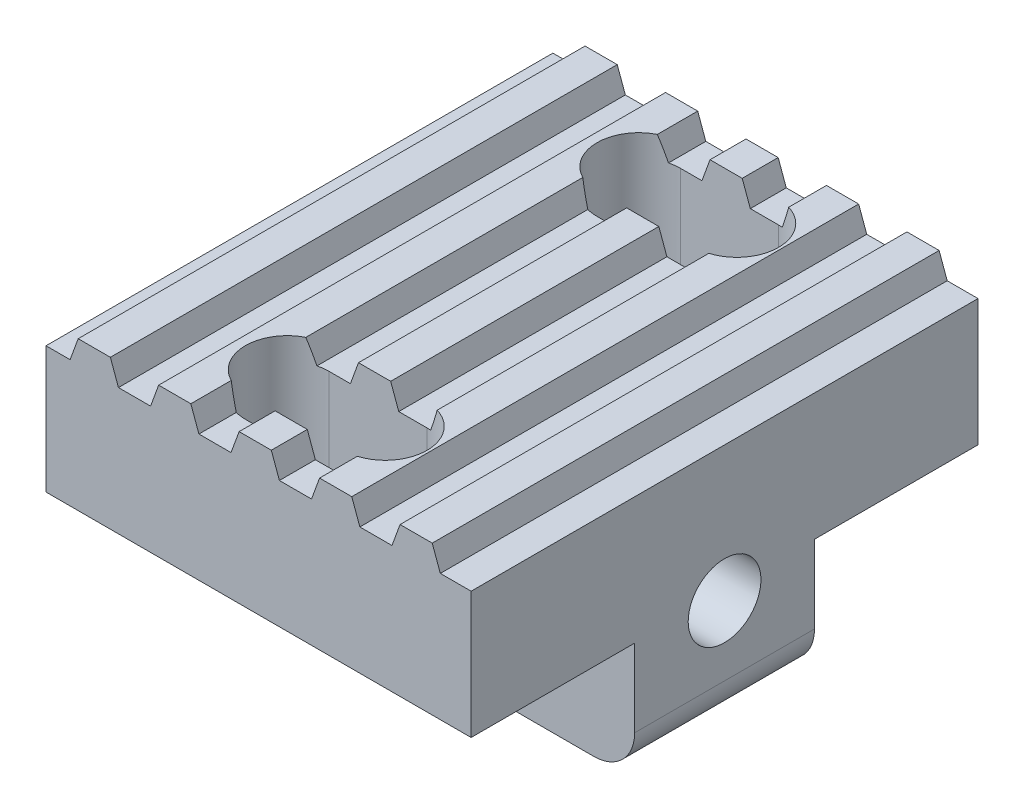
ISO-10303-21;
HEADER;
FILE_DESCRIPTION(('STEP AP214'),'2;1');
FILE_NAME('part.step','',(''),(''),'','','');
FILE_SCHEMA(('AUTOMOTIVE_DESIGN { 1 0 10303 214 1 1 1 1 }'));
ENDSEC;
DATA;
#1=APPLICATION_CONTEXT('core data for automotive mechanical design processes');
#2=APPLICATION_PROTOCOL_DEFINITION('international standard','automotive_design',2000,#1);
#3=PRODUCT_CONTEXT('',#1,'mechanical');
#4=PRODUCT('Part','Part','',(#3));
#5=PRODUCT_RELATED_PRODUCT_CATEGORY('part','',(#4));
#6=PRODUCT_DEFINITION_FORMATION('','',#4);
#7=PRODUCT_DEFINITION_CONTEXT('part definition',#1,'design');
#8=PRODUCT_DEFINITION('design','',#6,#7);
#9=PRODUCT_DEFINITION_SHAPE('','',#8);
#10=(LENGTH_UNIT() NAMED_UNIT(*) SI_UNIT(.MILLI.,.METRE.));
#11=(NAMED_UNIT(*) PLANE_ANGLE_UNIT() SI_UNIT($,.RADIAN.));
#12=(NAMED_UNIT(*) SI_UNIT($,.STERADIAN.) SOLID_ANGLE_UNIT());
#13=UNCERTAINTY_MEASURE_WITH_UNIT(LENGTH_MEASURE(1.E-05),#10,'distance_accuracy_value','');
#14=(GEOMETRIC_REPRESENTATION_CONTEXT(3) GLOBAL_UNCERTAINTY_ASSIGNED_CONTEXT((#13)) GLOBAL_UNIT_ASSIGNED_CONTEXT((#10,
#11,#12)) REPRESENTATION_CONTEXT('',''));
#15=CARTESIAN_POINT('',(0.,0.,0.));
#16=DIRECTION('',(0.,0.,1.));
#17=DIRECTION('',(1.,0.,0.));
#18=AXIS2_PLACEMENT_3D('',#15,#16,#17);
#19=CARTESIAN_POINT('',(13.208,-7.62000000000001,1.2490009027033E-13));
#20=DIRECTION('',(1.,0.,0.));
#21=DIRECTION('',(0.,0.,-1.));
#22=AXIS2_PLACEMENT_3D('',#19,#20,#21);
#23=PLANE('',#22);
#24=CARTESIAN_POINT('',(13.208,-4.191,7.87400000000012));
#25=DIRECTION('',(-1.,0.,0.));
#26=DIRECTION('',(0.,0.,1.));
#27=AXIS2_PLACEMENT_3D('',#24,#25,#26);
#28=CIRCLE('',#27,1.1303);
#29=CARTESIAN_POINT('',(13.208,-4.191,9.00430000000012));
#30=VERTEX_POINT('',#29);
#31=EDGE_CURVE('E429',#30,#30,#28,.T.);
#32=ORIENTED_EDGE('',*,*,#31,.T.);
#33=EDGE_LOOP('',(#32));
#34=FACE_BOUND('',#33,.T.);
#35=DIRECTION('',(0.,1.,0.));
#36=VECTOR('',#35,1.);
#37=CARTESIAN_POINT('',(13.208,-7.62000000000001,10.6680000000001));
#38=LINE('',#37,#36);
#39=CARTESIAN_POINT('',(13.208,-6.35000000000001,10.6680000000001));
#40=VERTEX_POINT('',#39);
#41=CARTESIAN_POINT('',(13.208,-3.937,10.6680000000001));
#42=VERTEX_POINT('',#41);
#43=EDGE_CURVE('E370',#40,#42,#38,.T.);
#44=ORIENTED_EDGE('',*,*,#43,.F.);
#45=DIRECTION('',(0.,0.,-1.));
#46=VECTOR('',#45,1.);
#47=CARTESIAN_POINT('',(13.208,-6.35000000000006,5.08000000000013));
#48=LINE('',#47,#46);
#49=CARTESIAN_POINT('',(13.208,-6.35000000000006,5.08000000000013));
#50=VERTEX_POINT('',#49);
#51=EDGE_CURVE('E726',#40,#50,#48,.T.);
#52=ORIENTED_EDGE('',*,*,#51,.T.);
#53=DIRECTION('',(0.,1.,0.));
#54=VECTOR('',#53,1.);
#55=CARTESIAN_POINT('',(13.208,-7.62000000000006,5.08000000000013));
#56=LINE('',#55,#54);
#57=CARTESIAN_POINT('',(13.208,-3.93700000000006,5.08000000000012));
#58=VERTEX_POINT('',#57);
#59=EDGE_CURVE('E408',#50,#58,#56,.T.);
#60=ORIENTED_EDGE('',*,*,#59,.T.);
#61=DIRECTION('',(0.,0.,-1.));
#62=VECTOR('',#61,1.);
#63=CARTESIAN_POINT('',(13.208,-3.937,0.));
#64=LINE('',#63,#62);
#65=CARTESIAN_POINT('',(13.208,-3.937,0.));
#66=VERTEX_POINT('',#65);
#67=EDGE_CURVE('E410',#58,#66,#64,.T.);
#68=ORIENTED_EDGE('',*,*,#67,.T.);
#69=DIRECTION('',(0.,1.,0.));
#70=VECTOR('',#69,1.);
#71=CARTESIAN_POINT('',(13.208,-7.62000000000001,1.2490009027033E-13));
#72=LINE('',#71,#70);
#73=CARTESIAN_POINT('',(13.208,0.,1.2490009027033E-13));
#74=VERTEX_POINT('',#73);
#75=EDGE_CURVE('E669',#66,#74,#72,.T.);
#76=ORIENTED_EDGE('',*,*,#75,.T.);
#77=DIRECTION('',(0.,0.,-1.));
#78=VECTOR('',#77,1.);
#79=CARTESIAN_POINT('',(13.208,0.,1.2490009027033E-13));
#80=LINE('',#79,#78);
#81=CARTESIAN_POINT('',(13.208,0.,15.7480000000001));
#82=VERTEX_POINT('',#81);
#83=EDGE_CURVE('E656',#82,#74,#80,.T.);
#84=ORIENTED_EDGE('',*,*,#83,.F.);
#85=DIRECTION('',(0.,1.,0.));
#86=VECTOR('',#85,1.);
#87=CARTESIAN_POINT('',(13.208,-7.62000000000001,15.7480000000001));
#88=LINE('',#87,#86);
#89=CARTESIAN_POINT('',(13.208,-3.937,15.7480000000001));
#90=VERTEX_POINT('',#89);
#91=EDGE_CURVE('E671',#90,#82,#88,.T.);
#92=ORIENTED_EDGE('',*,*,#91,.F.);
#93=DIRECTION('',(0.,0.,1.));
#94=VECTOR('',#93,1.);
#95=CARTESIAN_POINT('',(13.208,-3.937,15.7480000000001));
#96=LINE('',#95,#94);
#97=EDGE_CURVE('E387',#42,#90,#96,.T.);
#98=ORIENTED_EDGE('',*,*,#97,.F.);
#99=EDGE_LOOP('',(#44,#52,#60,#68,#76,#84,#92,#98));
#100=FACE_BOUND('',#99,.T.);
#101=ADVANCED_FACE('F30',(#34,#100),#23,.T.);
#102=CARTESIAN_POINT('',(0.,-7.62000000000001,15.7480000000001));
#103=DIRECTION('',(0.,1.,0.));
#104=DIRECTION('',(0.,0.,1.));
#105=AXIS2_PLACEMENT_3D('',#102,#103,#104);
#106=PLANE('',#105);
#107=DIRECTION('',(-1.,0.,0.));
#108=VECTOR('',#107,1.);
#109=CARTESIAN_POINT('',(13.208,-7.62000000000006,5.08000000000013));
#110=LINE('',#109,#108);
#111=CARTESIAN_POINT('',(11.938,-7.62000000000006,5.08000000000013));
#112=VERTEX_POINT('',#111);
#113=CARTESIAN_POINT('',(0.,-7.62000000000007,5.08));
#114=VERTEX_POINT('',#113);
#115=EDGE_CURVE('E413',#112,#114,#110,.T.);
#116=ORIENTED_EDGE('',*,*,#115,.F.);
#117=DIRECTION('',(0.,0.,-1.));
#118=VECTOR('',#117,1.);
#119=CARTESIAN_POINT('',(11.938,-7.62000000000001,10.6680000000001));
#120=LINE('',#119,#118);
#121=CARTESIAN_POINT('',(11.938,-7.62000000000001,10.6680000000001));
#122=VERTEX_POINT('',#121);
#123=EDGE_CURVE('E38',#112,#122,#120,.F.);
#124=ORIENTED_EDGE('',*,*,#123,.T.);
#125=DIRECTION('',(-1.,0.,0.));
#126=VECTOR('',#125,1.);
#127=CARTESIAN_POINT('',(13.208,-7.62000000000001,10.6680000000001));
#128=LINE('',#127,#126);
#129=CARTESIAN_POINT('',(0.,-7.62000000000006,10.668));
#130=VERTEX_POINT('',#129);
#131=EDGE_CURVE('E373',#122,#130,#128,.T.);
#132=ORIENTED_EDGE('',*,*,#131,.T.);
#133=DIRECTION('',(0.,0.,1.));
#134=VECTOR('',#133,1.);
#135=CARTESIAN_POINT('',(0.,-7.62000000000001,0.));
#136=LINE('',#135,#134);
#137=EDGE_CURVE('E386',#114,#130,#136,.T.);
#138=ORIENTED_EDGE('',*,*,#137,.F.);
#139=EDGE_LOOP('',(#116,#124,#132,#138));
#140=FACE_BOUND('',#139,.T.);
#141=ADVANCED_FACE('F821',(#140),#106,.F.);
#142=CARTESIAN_POINT('',(0.745220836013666,-0.0101745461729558,15.7480000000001));
#143=DIRECTION('',(0.,0.,1.));
#144=DIRECTION('',(1.,0.,0.));
#145=AXIS2_PLACEMENT_3D('',#142,#143,#144);
#146=PLANE('',#145);
#147=DIRECTION('',(0.,1.,0.));
#148=VECTOR('',#147,1.);
#149=CARTESIAN_POINT('',(0.,-7.62000000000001,15.7480000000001));
#150=LINE('',#149,#148);
#151=CARTESIAN_POINT('',(0.,-3.937,15.7480000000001));
#152=VERTEX_POINT('',#151);
#153=CARTESIAN_POINT('',(0.,0.,15.7480000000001));
#154=VERTEX_POINT('',#153);
#155=EDGE_CURVE('E665',#152,#154,#150,.T.);
#156=ORIENTED_EDGE('',*,*,#155,.F.);
#157=DIRECTION('',(-1.,0.,0.));
#158=VECTOR('',#157,1.);
#159=CARTESIAN_POINT('',(13.208,-3.937,15.7480000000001));
#160=LINE('',#159,#158);
#161=EDGE_CURVE('E374',#90,#152,#160,.T.);
#162=ORIENTED_EDGE('',*,*,#161,.F.);
#163=ORIENTED_EDGE('',*,*,#91,.T.);
#164=DIRECTION('',(1.,0.,0.));
#165=VECTOR('',#164,1.);
#166=CARTESIAN_POINT('',(0.,0.,15.7480000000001));
#167=LINE('',#166,#165);
#168=CARTESIAN_POINT('',(12.2510759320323,0.,15.7480000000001));
#169=VERTEX_POINT('',#168);
#170=EDGE_CURVE('E653',#169,#82,#167,.T.);
#171=ORIENTED_EDGE('',*,*,#170,.F.);
#172=DIRECTION('',(-0.342020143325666,0.939692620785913,0.));
#173=VECTOR('',#172,1.);
#174=CARTESIAN_POINT('',(12.,0.689825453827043,15.7480000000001));
#175=LINE('',#174,#173);
#176=CARTESIAN_POINT('',(12.,0.689825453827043,15.7480000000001));
#177=VERTEX_POINT('',#176);
#178=EDGE_CURVE('E543',#169,#177,#175,.T.);
#179=ORIENTED_EDGE('',*,*,#178,.T.);
#180=DIRECTION('',(-1.,0.,0.));
#181=VECTOR('',#180,1.);
#182=CARTESIAN_POINT('',(11.,0.689825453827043,15.7480000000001));
#183=LINE('',#182,#181);
#184=CARTESIAN_POINT('',(11.,0.689825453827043,15.7480000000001));
#185=VERTEX_POINT('',#184);
#186=EDGE_CURVE('E545',#177,#185,#183,.T.);
#187=ORIENTED_EDGE('',*,*,#186,.T.);
#188=DIRECTION('',(-0.342020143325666,-0.939692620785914,0.));
#189=VECTOR('',#188,1.);
#190=CARTESIAN_POINT('',(10.7452208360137,-0.0101745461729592,15.7480000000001));
#191=LINE('',#190,#189);
#192=CARTESIAN_POINT('',(10.7489240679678,0.,15.7480000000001));
#193=VERTEX_POINT('',#192);
#194=EDGE_CURVE('E547',#185,#193,#191,.T.);
#195=ORIENTED_EDGE('',*,*,#194,.T.);
#196=CARTESIAN_POINT('',(9.7510759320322,0.,15.7480000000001));
#197=VERTEX_POINT('',#196);
#198=EDGE_CURVE('E762',#197,#193,#167,.T.);
#199=ORIENTED_EDGE('',*,*,#198,.F.);
#200=DIRECTION('',(-0.342020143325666,0.939692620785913,0.));
#201=VECTOR('',#200,1.);
#202=CARTESIAN_POINT('',(9.49999999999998,0.689825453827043,15.7480000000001));
#203=LINE('',#202,#201);
#204=CARTESIAN_POINT('',(9.49999999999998,0.689825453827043,15.7480000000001));
#205=VERTEX_POINT('',#204);
#206=EDGE_CURVE('E569',#197,#205,#203,.T.);
#207=ORIENTED_EDGE('',*,*,#206,.T.);
#208=DIRECTION('',(-1.,0.,0.));
#209=VECTOR('',#208,1.);
#210=CARTESIAN_POINT('',(8.49999999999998,0.689825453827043,15.7480000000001));
#211=LINE('',#210,#209);
#212=CARTESIAN_POINT('',(8.49999999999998,0.689825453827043,15.7480000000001));
#213=VERTEX_POINT('',#212);
#214=EDGE_CURVE('E571',#205,#213,#211,.T.);
#215=ORIENTED_EDGE('',*,*,#214,.T.);
#216=DIRECTION('',(-0.342020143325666,-0.939692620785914,0.));
#217=VECTOR('',#216,1.);
#218=CARTESIAN_POINT('',(8.24522083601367,-0.0101745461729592,15.7480000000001));
#219=LINE('',#218,#217);
#220=CARTESIAN_POINT('',(8.24892406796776,0.,15.7480000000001));
#221=VERTEX_POINT('',#220);
#222=EDGE_CURVE('E573',#213,#221,#219,.T.);
#223=ORIENTED_EDGE('',*,*,#222,.T.);
#224=CARTESIAN_POINT('',(7.25107593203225,0.,15.7480000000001));
#225=VERTEX_POINT('',#224);
#226=EDGE_CURVE('E763',#225,#221,#167,.T.);
#227=ORIENTED_EDGE('',*,*,#226,.F.);
#228=DIRECTION('',(-0.342020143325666,0.939692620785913,0.));
#229=VECTOR('',#228,1.);
#230=CARTESIAN_POINT('',(7.00000000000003,0.689825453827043,15.7480000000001));
#231=LINE('',#230,#229);
#232=CARTESIAN_POINT('',(7.00000000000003,0.689825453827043,15.7480000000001));
#233=VERTEX_POINT('',#232);
#234=EDGE_CURVE('E600',#225,#233,#231,.T.);
#235=ORIENTED_EDGE('',*,*,#234,.T.);
#236=DIRECTION('',(-1.,0.,0.));
#237=VECTOR('',#236,1.);
#238=CARTESIAN_POINT('',(6.00000000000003,0.68982545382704,15.7480000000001));
#239=LINE('',#238,#237);
#240=CARTESIAN_POINT('',(6.00000000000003,0.68982545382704,15.7480000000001));
#241=VERTEX_POINT('',#240);
#242=EDGE_CURVE('E602',#233,#241,#239,.T.);
#243=ORIENTED_EDGE('',*,*,#242,.T.);
#244=DIRECTION('',(-0.342020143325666,-0.939692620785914,0.));
#245=VECTOR('',#244,1.);
#246=CARTESIAN_POINT('',(5.74522083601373,-0.0101745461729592,15.7480000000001));
#247=LINE('',#246,#245);
#248=CARTESIAN_POINT('',(5.74892406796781,0.,15.7480000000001));
#249=VERTEX_POINT('',#248);
#250=EDGE_CURVE('E604',#241,#249,#247,.T.);
#251=ORIENTED_EDGE('',*,*,#250,.T.);
#252=CARTESIAN_POINT('',(4.75107593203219,0.,15.7480000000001));
#253=VERTEX_POINT('',#252);
#254=EDGE_CURVE('E767',#253,#249,#167,.T.);
#255=ORIENTED_EDGE('',*,*,#254,.F.);
#256=DIRECTION('',(-0.342020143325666,0.939692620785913,0.));
#257=VECTOR('',#256,1.);
#258=CARTESIAN_POINT('',(4.49999999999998,0.68982545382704,15.7480000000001));
#259=LINE('',#258,#257);
#260=CARTESIAN_POINT('',(4.49999999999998,0.68982545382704,15.7480000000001));
#261=VERTEX_POINT('',#260);
#262=EDGE_CURVE('E635',#253,#261,#259,.T.);
#263=ORIENTED_EDGE('',*,*,#262,.T.);
#264=DIRECTION('',(-1.,0.,0.));
#265=VECTOR('',#264,1.);
#266=CARTESIAN_POINT('',(3.49999999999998,0.68982545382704,15.7480000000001));
#267=LINE('',#266,#265);
#268=CARTESIAN_POINT('',(3.49999999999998,0.68982545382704,15.7480000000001));
#269=VERTEX_POINT('',#268);
#270=EDGE_CURVE('E637',#261,#269,#267,.T.);
#271=ORIENTED_EDGE('',*,*,#270,.T.);
#272=DIRECTION('',(-0.342020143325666,-0.939692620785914,0.));
#273=VECTOR('',#272,1.);
#274=CARTESIAN_POINT('',(3.24522083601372,-0.0101745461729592,15.7480000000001));
#275=LINE('',#274,#273);
#276=CARTESIAN_POINT('',(3.24892406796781,0.,15.7480000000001));
#277=VERTEX_POINT('',#276);
#278=EDGE_CURVE('E639',#269,#277,#275,.T.);
#279=ORIENTED_EDGE('',*,*,#278,.T.);
#280=CARTESIAN_POINT('',(2.25107593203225,0.,15.7480000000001));
#281=VERTEX_POINT('',#280);
#282=EDGE_CURVE('E657',#281,#277,#167,.T.);
#283=ORIENTED_EDGE('',*,*,#282,.F.);
#284=DIRECTION('',(-0.342020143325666,0.939692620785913,0.));
#285=VECTOR('',#284,1.);
#286=CARTESIAN_POINT('',(2.00000000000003,0.689825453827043,15.7480000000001));
#287=LINE('',#286,#285);
#288=CARTESIAN_POINT('',(2.00000000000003,0.689825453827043,15.7480000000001));
#289=VERTEX_POINT('',#288);
#290=EDGE_CURVE('E686',#281,#289,#287,.T.);
#291=ORIENTED_EDGE('',*,*,#290,.T.);
#292=DIRECTION('',(-1.,0.,0.));
#293=VECTOR('',#292,1.);
#294=CARTESIAN_POINT('',(1.00000000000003,0.689825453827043,15.7480000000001));
#295=LINE('',#294,#293);
#296=CARTESIAN_POINT('',(1.00000000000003,0.689825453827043,15.7480000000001));
#297=VERTEX_POINT('',#296);
#298=EDGE_CURVE('E688',#289,#297,#295,.T.);
#299=ORIENTED_EDGE('',*,*,#298,.T.);
#300=DIRECTION('',(-0.342020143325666,-0.939692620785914,0.));
#301=VECTOR('',#300,1.);
#302=CARTESIAN_POINT('',(0.745220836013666,-0.0101745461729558,15.7480000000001));
#303=LINE('',#302,#301);
#304=CARTESIAN_POINT('',(0.748924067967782,0.,15.7480000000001));
#305=VERTEX_POINT('',#304);
#306=EDGE_CURVE('E690',#297,#305,#303,.T.);
#307=ORIENTED_EDGE('',*,*,#306,.T.);
#308=EDGE_CURVE('E654',#154,#305,#167,.T.);
#309=ORIENTED_EDGE('',*,*,#308,.F.);
#310=EDGE_LOOP('',(#156,#162,#163,#171,#179,#187,#195,#199,#207,#215,#223,#227,#235,#243,#251,
#255,#263,#271,#279,#283,#291,#299,#307,#309));
#311=FACE_BOUND('',#310,.T.);
#312=ADVANCED_FACE('F759',(#311),#146,.T.);
#313=CARTESIAN_POINT('',(0.,-7.62000000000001,0.));
#314=DIRECTION('',(-1.,0.,0.));
#315=DIRECTION('',(0.,0.,1.));
#316=AXIS2_PLACEMENT_3D('',#313,#314,#315);
#317=PLANE('',#316);
#318=CARTESIAN_POINT('',(0.,-4.191,7.874));
#319=DIRECTION('',(-1.,0.,0.));
#320=DIRECTION('',(0.,0.,1.));
#321=AXIS2_PLACEMENT_3D('',#318,#319,#320);
#322=CIRCLE('',#321,1.1303);
#323=CARTESIAN_POINT('',(0.,-4.191,9.0043));
#324=VERTEX_POINT('',#323);
#325=EDGE_CURVE('E432',#324,#324,#322,.T.);
#326=ORIENTED_EDGE('',*,*,#325,.F.);
#327=EDGE_LOOP('',(#326));
#328=FACE_BOUND('',#327,.T.);
#329=ORIENTED_EDGE('',*,*,#137,.T.);
#330=DIRECTION('',(0.,1.,0.));
#331=VECTOR('',#330,1.);
#332=CARTESIAN_POINT('',(0.,-7.62000000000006,10.668));
#333=LINE('',#332,#331);
#334=CARTESIAN_POINT('',(0.,-3.93700000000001,10.668));
#335=VERTEX_POINT('',#334);
#336=EDGE_CURVE('E367',#130,#335,#333,.T.);
#337=ORIENTED_EDGE('',*,*,#336,.T.);
#338=DIRECTION('',(0.,0.,1.));
#339=VECTOR('',#338,1.);
#340=CARTESIAN_POINT('',(0.,-3.937,15.7480000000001));
#341=LINE('',#340,#339);
#342=EDGE_CURVE('E377',#335,#152,#341,.T.);
#343=ORIENTED_EDGE('',*,*,#342,.T.);
#344=ORIENTED_EDGE('',*,*,#155,.T.);
#345=DIRECTION('',(0.,0.,1.));
#346=VECTOR('',#345,1.);
#347=CARTESIAN_POINT('',(0.,0.,0.));
#348=LINE('',#347,#346);
#349=CARTESIAN_POINT('',(0.,0.,0.));
#350=VERTEX_POINT('',#349);
#351=EDGE_CURVE('E649',#350,#154,#348,.T.);
#352=ORIENTED_EDGE('',*,*,#351,.F.);
#353=DIRECTION('',(0.,1.,0.));
#354=VECTOR('',#353,1.);
#355=CARTESIAN_POINT('',(0.,-7.62000000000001,0.));
#356=LINE('',#355,#354);
#357=CARTESIAN_POINT('',(0.,-3.937,0.));
#358=VERTEX_POINT('',#357);
#359=EDGE_CURVE('E666',#358,#350,#356,.T.);
#360=ORIENTED_EDGE('',*,*,#359,.F.);
#361=DIRECTION('',(0.,0.,-1.));
#362=VECTOR('',#361,1.);
#363=CARTESIAN_POINT('',(0.,-3.937,0.));
#364=LINE('',#363,#362);
#365=CARTESIAN_POINT('',(0.,-3.93700000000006,5.08));
#366=VERTEX_POINT('',#365);
#367=EDGE_CURVE('E406',#366,#358,#364,.T.);
#368=ORIENTED_EDGE('',*,*,#367,.F.);
#369=DIRECTION('',(0.,1.,0.));
#370=VECTOR('',#369,1.);
#371=CARTESIAN_POINT('',(0.,-7.62000000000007,5.08));
#372=LINE('',#371,#370);
#373=EDGE_CURVE('E403',#114,#366,#372,.T.);
#374=ORIENTED_EDGE('',*,*,#373,.F.);
#375=EDGE_LOOP('',(#329,#337,#343,#344,#352,#360,#368,#374));
#376=FACE_BOUND('',#375,.T.);
#377=ADVANCED_FACE('F383',(#328,#376),#317,.T.);
#378=CARTESIAN_POINT('',(5.08,0.689825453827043,13.3350000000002));
#379=DIRECTION('',(0.,-1.,0.));
#380=DIRECTION('',(0.,0.,-1.));
#381=AXIS2_PLACEMENT_3D('',#378,#379,#380);
#382=CYLINDRICAL_SURFACE('',#381,1.2954);
#383=DIRECTION('',(0.,-1.,0.));
#384=VECTOR('',#383,1.);
#385=CARTESIAN_POINT('',(5.08,0.689825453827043,14.6304000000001));
#386=LINE('',#385,#384);
#387=CARTESIAN_POINT('',(5.08,0.,14.6304000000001));
#388=VERTEX_POINT('',#387);
#389=CARTESIAN_POINT('',(5.08,-3.937,14.6304000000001));
#390=VERTEX_POINT('',#389);
#391=EDGE_CURVE('E444',#388,#390,#386,.T.);
#392=ORIENTED_EDGE('',*,*,#391,.T.);
#393=CARTESIAN_POINT('',(5.08,-3.93700000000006,13.3350000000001));
#394=DIRECTION('',(0.,-1.,0.));
#395=DIRECTION('',(0.,0.,-1.));
#396=AXIS2_PLACEMENT_3D('',#393,#394,#395);
#397=CIRCLE('',#396,1.2954);
#398=CARTESIAN_POINT('',(5.08,-3.93700000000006,12.0396000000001));
#399=VERTEX_POINT('',#398);
#400=EDGE_CURVE('E400',#390,#399,#397,.T.);
#401=ORIENTED_EDGE('',*,*,#400,.T.);
#402=DIRECTION('',(0.,-1.,0.));
#403=VECTOR('',#402,1.);
#404=CARTESIAN_POINT('',(5.08,0.689825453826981,12.0396000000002));
#405=LINE('',#404,#403);
#406=CARTESIAN_POINT('',(5.08,0.,12.0396000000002));
#407=VERTEX_POINT('',#406);
#408=EDGE_CURVE('E443',#407,#399,#405,.T.);
#409=ORIENTED_EDGE('',*,*,#408,.F.);
#410=CARTESIAN_POINT('',(5.08,0.,13.3350000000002));
#411=DIRECTION('',(0.,1.,0.));
#412=DIRECTION('',(0.,0.,1.));
#413=AXIS2_PLACEMENT_3D('',#410,#411,#412);
#414=CIRCLE('',#413,1.2954);
#415=CARTESIAN_POINT('',(4.75107593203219,0.,12.0820554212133));
#416=VERTEX_POINT('',#415);
#417=EDGE_CURVE('E465',#416,#407,#414,.F.);
#418=ORIENTED_EDGE('',*,*,#417,.F.);
#419=CARTESIAN_POINT('',(5.08,-0.903711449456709,13.3350000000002));
#420=DIRECTION('',(-0.939692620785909,-0.342020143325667,0.));
#421=DIRECTION('',(0.342020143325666,-0.939692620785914,0.));
#422=AXIS2_PLACEMENT_3D('',#419,#420,#421);
#423=ELLIPSE('',#422,3.78749621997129,1.2954);
#424=CARTESIAN_POINT('',(4.49999999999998,0.689825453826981,12.1766990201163));
#425=VERTEX_POINT('',#424);
#426=EDGE_CURVE('E462',#416,#425,#423,.F.);
#427=ORIENTED_EDGE('',*,*,#426,.T.);
#428=CARTESIAN_POINT('',(5.08,0.689825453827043,13.3350000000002));
#429=DIRECTION('',(0.,1.,0.));
#430=DIRECTION('',(0.,0.,1.));
#431=AXIS2_PLACEMENT_3D('',#428,#429,#430);
#432=CIRCLE('',#431,1.2954);
#433=CARTESIAN_POINT('',(4.49999999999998,0.689825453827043,14.493300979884));
#434=VERTEX_POINT('',#433);
#435=EDGE_CURVE('E435',#425,#434,#432,.T.);
#436=ORIENTED_EDGE('',*,*,#435,.T.);
#437=CARTESIAN_POINT('',(4.75107593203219,0.,14.587944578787));
#438=VERTEX_POINT('',#437);
#439=EDGE_CURVE('E459',#434,#438,#423,.F.);
#440=ORIENTED_EDGE('',*,*,#439,.T.);
#441=EDGE_CURVE('E461',#388,#438,#414,.F.);
#442=ORIENTED_EDGE('',*,*,#441,.F.);
#443=EDGE_LOOP('',(#392,#401,#409,#418,#427,#436,#440,#442));
#444=FACE_BOUND('',#443,.T.);
#445=ADVANCED_FACE('F831',(#444),#382,.F.);
#446=CARTESIAN_POINT('',(8.12800000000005,0.689825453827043,14.6304000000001));
#447=DIRECTION('',(0.,0.,-1.));
#448=DIRECTION('',(-1.,0.,0.));
#449=AXIS2_PLACEMENT_3D('',#446,#447,#448);
#450=PLANE('',#449);
#451=DIRECTION('',(0.,-1.,0.));
#452=VECTOR('',#451,1.);
#453=CARTESIAN_POINT('',(8.12800000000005,0.689825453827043,14.6304000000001));
#454=LINE('',#453,#452);
#455=CARTESIAN_POINT('',(8.12800000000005,0.,14.6304000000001));
#456=VERTEX_POINT('',#455);
#457=CARTESIAN_POINT('',(8.12800000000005,-3.937,14.6304000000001));
#458=VERTEX_POINT('',#457);
#459=EDGE_CURVE('E448',#456,#458,#454,.T.);
#460=ORIENTED_EDGE('',*,*,#459,.T.);
#461=DIRECTION('',(-1.,0.,0.));
#462=VECTOR('',#461,1.);
#463=CARTESIAN_POINT('',(8.12800000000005,-3.937,14.6304000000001));
#464=LINE('',#463,#462);
#465=EDGE_CURVE('E397',#458,#390,#464,.T.);
#466=ORIENTED_EDGE('',*,*,#465,.T.);
#467=ORIENTED_EDGE('',*,*,#391,.F.);
#468=DIRECTION('',(-1.,0.,0.));
#469=VECTOR('',#468,1.);
#470=CARTESIAN_POINT('',(0.,0.,14.6304000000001));
#471=LINE('',#470,#469);
#472=CARTESIAN_POINT('',(5.74892406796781,0.,14.6304000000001));
#473=VERTEX_POINT('',#472);
#474=EDGE_CURVE('E478',#473,#388,#471,.T.);
#475=ORIENTED_EDGE('',*,*,#474,.F.);
#476=DIRECTION('',(0.342020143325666,0.939692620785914,0.));
#477=VECTOR('',#476,1.);
#478=CARTESIAN_POINT('',(5.74522083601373,-0.0101745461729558,14.6304000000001));
#479=LINE('',#478,#477);
#480=CARTESIAN_POINT('',(6.00000000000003,0.689825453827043,14.6304000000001));
#481=VERTEX_POINT('',#480);
#482=EDGE_CURVE('E476',#473,#481,#479,.T.);
#483=ORIENTED_EDGE('',*,*,#482,.T.);
#484=DIRECTION('',(1.,0.,0.));
#485=VECTOR('',#484,1.);
#486=CARTESIAN_POINT('',(8.12800000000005,0.689825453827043,14.6304000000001));
#487=LINE('',#486,#485);
#488=CARTESIAN_POINT('',(7.00000000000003,0.689825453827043,14.6304000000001));
#489=VERTEX_POINT('',#488);
#490=EDGE_CURVE('E441',#481,#489,#487,.T.);
#491=ORIENTED_EDGE('',*,*,#490,.T.);
#492=DIRECTION('',(0.342020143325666,-0.939692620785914,0.));
#493=VECTOR('',#492,1.);
#494=CARTESIAN_POINT('',(7.00000000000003,0.689825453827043,14.6304000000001));
#495=LINE('',#494,#493);
#496=CARTESIAN_POINT('',(7.25107593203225,0.,14.6304000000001));
#497=VERTEX_POINT('',#496);
#498=EDGE_CURVE('E481',#489,#497,#495,.T.);
#499=ORIENTED_EDGE('',*,*,#498,.T.);
#500=DIRECTION('',(-1.,0.,0.));
#501=VECTOR('',#500,1.);
#502=CARTESIAN_POINT('',(0.,0.,14.6304000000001));
#503=LINE('',#502,#501);
#504=EDGE_CURVE('E483',#456,#497,#503,.T.);
#505=ORIENTED_EDGE('',*,*,#504,.F.);
#506=EDGE_LOOP('',(#460,#466,#467,#475,#483,#491,#499,#505));
#507=FACE_BOUND('',#506,.T.);
#508=ADVANCED_FACE('F1010',(#507),#450,.T.);
#509=CARTESIAN_POINT('',(8.12800000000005,0.689825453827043,13.3350000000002));
#510=DIRECTION('',(0.,-1.,0.));
#511=DIRECTION('',(0.,0.,-1.));
#512=AXIS2_PLACEMENT_3D('',#509,#510,#511);
#513=CYLINDRICAL_SURFACE('',#512,1.2954);
#514=DIRECTION('',(0.,-1.,0.));
#515=VECTOR('',#514,1.);
#516=CARTESIAN_POINT('',(8.12800000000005,0.689825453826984,12.0396000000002));
#517=LINE('',#516,#515);
#518=CARTESIAN_POINT('',(8.12800000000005,0.,12.0396000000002));
#519=VERTEX_POINT('',#518);
#520=CARTESIAN_POINT('',(8.12800000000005,-3.93700000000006,12.0396000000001));
#521=VERTEX_POINT('',#520);
#522=EDGE_CURVE('E451',#519,#521,#517,.T.);
#523=ORIENTED_EDGE('',*,*,#522,.T.);
#524=CARTESIAN_POINT('',(8.12800000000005,-3.937,13.3350000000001));
#525=DIRECTION('',(0.,-1.,0.));
#526=DIRECTION('',(0.,0.,-1.));
#527=AXIS2_PLACEMENT_3D('',#524,#525,#526);
#528=CIRCLE('',#527,1.2954);
#529=EDGE_CURVE('E392',#521,#458,#528,.T.);
#530=ORIENTED_EDGE('',*,*,#529,.T.);
#531=ORIENTED_EDGE('',*,*,#459,.F.);
#532=CARTESIAN_POINT('',(8.12800000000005,0.,13.3350000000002));
#533=DIRECTION('',(0.,1.,0.));
#534=DIRECTION('',(0.,0.,1.));
#535=AXIS2_PLACEMENT_3D('',#532,#533,#534);
#536=CIRCLE('',#535,1.2954);
#537=CARTESIAN_POINT('',(8.24892406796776,0.,14.6247435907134));
#538=VERTEX_POINT('',#537);
#539=EDGE_CURVE('E458',#538,#456,#536,.F.);
#540=ORIENTED_EDGE('',*,*,#539,.F.);
#541=CARTESIAN_POINT('',(8.12800000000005,-0.332236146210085,13.3350000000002));
#542=DIRECTION('',(0.93969262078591,-0.342020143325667,0.));
#543=DIRECTION('',(-0.342020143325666,-0.939692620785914,0.));
#544=AXIS2_PLACEMENT_3D('',#541,#542,#543);
#545=ELLIPSE('',#544,3.7874962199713,1.2954);
#546=CARTESIAN_POINT('',(8.49999999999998,0.689825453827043,14.5758372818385));
#547=VERTEX_POINT('',#546);
#548=EDGE_CURVE('E719',#538,#547,#545,.F.);
#549=ORIENTED_EDGE('',*,*,#548,.T.);
#550=CARTESIAN_POINT('',(8.12800000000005,0.689825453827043,13.3350000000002));
#551=DIRECTION('',(0.,1.,0.));
#552=DIRECTION('',(0.,0.,1.));
#553=AXIS2_PLACEMENT_3D('',#550,#551,#552);
#554=CIRCLE('',#553,1.2954);
#555=CARTESIAN_POINT('',(8.49999999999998,0.689825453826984,12.0941627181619));
#556=VERTEX_POINT('',#555);
#557=EDGE_CURVE('E439',#547,#556,#554,.T.);
#558=ORIENTED_EDGE('',*,*,#557,.T.);
#559=CARTESIAN_POINT('',(8.24892406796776,0.,12.0452564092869));
#560=VERTEX_POINT('',#559);
#561=EDGE_CURVE('E717',#556,#560,#545,.F.);
#562=ORIENTED_EDGE('',*,*,#561,.T.);
#563=EDGE_CURVE('E447',#519,#560,#536,.F.);
#564=ORIENTED_EDGE('',*,*,#563,.F.);
#565=EDGE_LOOP('',(#523,#530,#531,#540,#549,#558,#562,#564));
#566=FACE_BOUND('',#565,.T.);
#567=ADVANCED_FACE('F1013',(#566),#513,.F.);
#568=CARTESIAN_POINT('',(8.12800000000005,0.689825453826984,12.0396000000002));
#569=DIRECTION('',(0.,0.,1.));
#570=DIRECTION('',(1.,0.,0.));
#571=AXIS2_PLACEMENT_3D('',#568,#569,#570);
#572=PLANE('',#571);
#573=ORIENTED_EDGE('',*,*,#408,.T.);
#574=DIRECTION('',(1.,0.,0.));
#575=VECTOR('',#574,1.);
#576=CARTESIAN_POINT('',(8.12800000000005,-3.93700000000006,12.0396000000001));
#577=LINE('',#576,#575);
#578=EDGE_CURVE('E723',#399,#521,#577,.T.);
#579=ORIENTED_EDGE('',*,*,#578,.T.);
#580=ORIENTED_EDGE('',*,*,#522,.F.);
#581=DIRECTION('',(1.,0.,0.));
#582=VECTOR('',#581,1.);
#583=CARTESIAN_POINT('',(0.,0.,12.0396));
#584=LINE('',#583,#582);
#585=CARTESIAN_POINT('',(7.25107593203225,0.,12.0396000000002));
#586=VERTEX_POINT('',#585);
#587=EDGE_CURVE('E473',#586,#519,#584,.T.);
#588=ORIENTED_EDGE('',*,*,#587,.F.);
#589=DIRECTION('',(-0.342020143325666,0.939692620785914,0.));
#590=VECTOR('',#589,1.);
#591=CARTESIAN_POINT('',(7.00000000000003,0.689825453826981,12.0396000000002));
#592=LINE('',#591,#590);
#593=CARTESIAN_POINT('',(7.00000000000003,0.689825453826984,12.0396000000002));
#594=VERTEX_POINT('',#593);
#595=EDGE_CURVE('E471',#586,#594,#592,.T.);
#596=ORIENTED_EDGE('',*,*,#595,.T.);
#597=DIRECTION('',(-1.,0.,0.));
#598=VECTOR('',#597,1.);
#599=CARTESIAN_POINT('',(8.12800000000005,0.689825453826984,12.0396000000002));
#600=LINE('',#599,#598);
#601=CARTESIAN_POINT('',(6.00000000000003,0.689825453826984,12.0396000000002));
#602=VERTEX_POINT('',#601);
#603=EDGE_CURVE('E437',#594,#602,#600,.T.);
#604=ORIENTED_EDGE('',*,*,#603,.T.);
#605=DIRECTION('',(-0.342020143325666,-0.939692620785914,0.));
#606=VECTOR('',#605,1.);
#607=CARTESIAN_POINT('',(5.74522083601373,-0.0101745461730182,12.0396000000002));
#608=LINE('',#607,#606);
#609=CARTESIAN_POINT('',(5.74892406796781,0.,12.0396000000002));
#610=VERTEX_POINT('',#609);
#611=EDGE_CURVE('E466',#602,#610,#608,.T.);
#612=ORIENTED_EDGE('',*,*,#611,.T.);
#613=DIRECTION('',(1.,0.,0.));
#614=VECTOR('',#613,1.);
#615=CARTESIAN_POINT('',(0.,0.,12.0396));
#616=LINE('',#615,#614);
#617=EDGE_CURVE('E468',#407,#610,#616,.T.);
#618=ORIENTED_EDGE('',*,*,#617,.F.);
#619=EDGE_LOOP('',(#573,#579,#580,#588,#596,#604,#612,#618));
#620=FACE_BOUND('',#619,.T.);
#621=ADVANCED_FACE('F1017',(#620),#572,.T.);
#622=CARTESIAN_POINT('',(0.,0.,15.7480000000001));
#623=DIRECTION('',(0.,1.,0.));
#624=DIRECTION('',(0.,0.,1.));
#625=AXIS2_PLACEMENT_3D('',#622,#623,#624);
#626=PLANE('',#625);
#627=ORIENTED_EDGE('',*,*,#539,.T.);
#628=ORIENTED_EDGE('',*,*,#504,.T.);
#629=DIRECTION('',(0.,0.,1.));
#630=VECTOR('',#629,1.);
#631=CARTESIAN_POINT('',(7.25107593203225,0.,15.7480000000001));
#632=LINE('',#631,#630);
#633=EDGE_CURVE('E621',#497,#225,#632,.T.);
#634=ORIENTED_EDGE('',*,*,#633,.T.);
#635=ORIENTED_EDGE('',*,*,#226,.T.);
#636=DIRECTION('',(0.,0.,-1.));
#637=VECTOR('',#636,1.);
#638=CARTESIAN_POINT('',(8.24892406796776,0.,15.7480000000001));
#639=LINE('',#638,#637);
#640=EDGE_CURVE('E585',#221,#538,#639,.T.);
#641=ORIENTED_EDGE('',*,*,#640,.T.);
#642=EDGE_LOOP('',(#627,#628,#634,#635,#641));
#643=FACE_BOUND('',#642,.T.);
#644=ADVANCED_FACE('F1021',(#643),#626,.T.);
#645=ORIENTED_EDGE('',*,*,#587,.T.);
#646=ORIENTED_EDGE('',*,*,#563,.T.);
#647=CARTESIAN_POINT('',(8.24892406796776,0.,3.70274359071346));
#648=VERTEX_POINT('',#647);
#649=EDGE_CURVE('E589',#560,#648,#639,.T.);
#650=ORIENTED_EDGE('',*,*,#649,.T.);
#651=CARTESIAN_POINT('',(8.12800000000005,0.,2.41300000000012));
#652=DIRECTION('',(0.,1.,0.));
#653=DIRECTION('',(0.,0.,1.));
#654=AXIS2_PLACEMENT_3D('',#651,#652,#653);
#655=CIRCLE('',#654,1.2954);
#656=CARTESIAN_POINT('',(8.12800000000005,0.,3.70840000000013));
#657=VERTEX_POINT('',#656);
#658=EDGE_CURVE('E502',#657,#648,#655,.T.);
#659=ORIENTED_EDGE('',*,*,#658,.F.);
#660=DIRECTION('',(1.,0.,0.));
#661=VECTOR('',#660,1.);
#662=CARTESIAN_POINT('',(0.,0.,3.7084));
#663=LINE('',#662,#661);
#664=CARTESIAN_POINT('',(7.25107593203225,0.,3.70840000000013));
#665=VERTEX_POINT('',#664);
#666=EDGE_CURVE('E527',#665,#657,#663,.T.);
#667=ORIENTED_EDGE('',*,*,#666,.F.);
#668=EDGE_CURVE('E627',#665,#586,#632,.T.);
#669=ORIENTED_EDGE('',*,*,#668,.T.);
#670=EDGE_LOOP('',(#645,#646,#650,#659,#667,#669));
#671=FACE_BOUND('',#670,.T.);
#672=ADVANCED_FACE('F1046',(#671),#626,.T.);
#673=ORIENTED_EDGE('',*,*,#474,.T.);
#674=ORIENTED_EDGE('',*,*,#441,.T.);
#675=DIRECTION('',(0.,0.,1.));
#676=VECTOR('',#675,1.);
#677=CARTESIAN_POINT('',(4.75107593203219,0.,15.7480000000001));
#678=LINE('',#677,#676);
#679=EDGE_CURVE('E702',#438,#253,#678,.T.);
#680=ORIENTED_EDGE('',*,*,#679,.T.);
#681=ORIENTED_EDGE('',*,*,#254,.T.);
#682=DIRECTION('',(0.,0.,-1.));
#683=VECTOR('',#682,1.);
#684=CARTESIAN_POINT('',(5.74892406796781,0.,15.7480000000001));
#685=LINE('',#684,#683);
#686=EDGE_CURVE('E618',#249,#473,#685,.T.);
#687=ORIENTED_EDGE('',*,*,#686,.T.);
#688=EDGE_LOOP('',(#673,#674,#680,#681,#687));
#689=FACE_BOUND('',#688,.T.);
#690=ADVANCED_FACE('F1049',(#689),#626,.T.);
#691=CARTESIAN_POINT('',(4.75107593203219,0.,3.66594457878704));
#692=VERTEX_POINT('',#691);
#693=EDGE_CURVE('E707',#692,#416,#678,.T.);
#694=ORIENTED_EDGE('',*,*,#693,.T.);
#695=ORIENTED_EDGE('',*,*,#417,.T.);
#696=ORIENTED_EDGE('',*,*,#617,.T.);
#697=CARTESIAN_POINT('',(5.74892406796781,0.,3.70840000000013));
#698=VERTEX_POINT('',#697);
#699=EDGE_CURVE('E622',#610,#698,#685,.T.);
#700=ORIENTED_EDGE('',*,*,#699,.T.);
#701=DIRECTION('',(1.,0.,0.));
#702=VECTOR('',#701,1.);
#703=CARTESIAN_POINT('',(0.,0.,3.7084));
#704=LINE('',#703,#702);
#705=CARTESIAN_POINT('',(5.08,0.,3.70840000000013));
#706=VERTEX_POINT('',#705);
#707=EDGE_CURVE('E521',#706,#698,#704,.T.);
#708=ORIENTED_EDGE('',*,*,#707,.F.);
#709=CARTESIAN_POINT('',(5.08,0.,2.41300000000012));
#710=DIRECTION('',(0.,1.,0.));
#711=DIRECTION('',(0.,0.,1.));
#712=AXIS2_PLACEMENT_3D('',#709,#710,#711);
#713=CIRCLE('',#712,1.2954);
#714=EDGE_CURVE('E535',#692,#706,#713,.T.);
#715=ORIENTED_EDGE('',*,*,#714,.F.);
#716=EDGE_LOOP('',(#694,#695,#696,#700,#708,#715));
#717=FACE_BOUND('',#716,.T.);
#718=ADVANCED_FACE('F1043',(#717),#626,.T.);
#719=CARTESIAN_POINT('',(4.49999999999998,0.68982545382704,15.7480000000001));
#720=DIRECTION('',(-0.939692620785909,-0.342020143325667,0.));
#721=DIRECTION('',(0.342020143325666,-0.939692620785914,0.));
#722=AXIS2_PLACEMENT_3D('',#719,#720,#721);
#723=PLANE('',#722);
#724=ORIENTED_EDGE('',*,*,#426,.F.);
#725=ORIENTED_EDGE('',*,*,#693,.F.);
#726=CARTESIAN_POINT('',(5.08,-0.90371144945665,2.41300000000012));
#727=DIRECTION('',(-0.939692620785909,-0.342020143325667,0.));
#728=DIRECTION('',(0.342020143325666,-0.939692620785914,0.));
#729=AXIS2_PLACEMENT_3D('',#726,#727,#728);
#730=ELLIPSE('',#729,3.78749621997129,1.2954);
#731=CARTESIAN_POINT('',(4.49999999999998,0.689825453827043,3.57130097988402));
#732=VERTEX_POINT('',#731);
#733=EDGE_CURVE('E533',#692,#732,#730,.T.);
#734=ORIENTED_EDGE('',*,*,#733,.T.);
#735=DIRECTION('',(0.,0.,-1.));
#736=VECTOR('',#735,1.);
#737=CARTESIAN_POINT('',(4.49999999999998,0.68982545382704,15.7480000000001));
#738=LINE('',#737,#736);
#739=EDGE_CURVE('E650',#425,#732,#738,.T.);
#740=ORIENTED_EDGE('',*,*,#739,.F.);
#741=EDGE_LOOP('',(#724,#725,#734,#740));
#742=FACE_BOUND('',#741,.T.);
#743=ADVANCED_FACE('F864',(#742),#723,.F.);
#744=ORIENTED_EDGE('',*,*,#439,.F.);
#745=EDGE_CURVE('E646',#261,#434,#738,.T.);
#746=ORIENTED_EDGE('',*,*,#745,.F.);
#747=ORIENTED_EDGE('',*,*,#262,.F.);
#748=ORIENTED_EDGE('',*,*,#679,.F.);
#749=EDGE_LOOP('',(#744,#746,#747,#748));
#750=FACE_BOUND('',#749,.T.);
#751=ADVANCED_FACE('F865',(#750),#723,.F.);
#752=CARTESIAN_POINT('',(7.00000000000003,0.689825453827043,15.7480000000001));
#753=DIRECTION('',(-0.939692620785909,-0.342020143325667,0.));
#754=DIRECTION('',(0.342020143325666,-0.939692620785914,0.));
#755=AXIS2_PLACEMENT_3D('',#752,#753,#754);
#756=PLANE('',#755);
#757=ORIENTED_EDGE('',*,*,#498,.F.);
#758=DIRECTION('',(0.,0.,-1.));
#759=VECTOR('',#758,1.);
#760=CARTESIAN_POINT('',(7.00000000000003,0.689825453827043,15.7480000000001));
#761=LINE('',#760,#759);
#762=EDGE_CURVE('E613',#233,#489,#761,.T.);
#763=ORIENTED_EDGE('',*,*,#762,.F.);
#764=ORIENTED_EDGE('',*,*,#234,.F.);
#765=ORIENTED_EDGE('',*,*,#633,.F.);
#766=EDGE_LOOP('',(#757,#763,#764,#765));
#767=FACE_BOUND('',#766,.T.);
#768=ADVANCED_FACE('F881',(#767),#756,.F.);
#769=ORIENTED_EDGE('',*,*,#595,.F.);
#770=ORIENTED_EDGE('',*,*,#668,.F.);
#771=DIRECTION('',(-0.342020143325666,0.939692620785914,0.));
#772=VECTOR('',#771,1.);
#773=CARTESIAN_POINT('',(7.00000000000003,0.689825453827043,3.70840000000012));
#774=LINE('',#773,#772);
#775=CARTESIAN_POINT('',(7.00000000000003,0.68982545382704,3.70840000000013));
#776=VERTEX_POINT('',#775);
#777=EDGE_CURVE('E524',#665,#776,#774,.T.);
#778=ORIENTED_EDGE('',*,*,#777,.T.);
#779=EDGE_CURVE('E617',#594,#776,#761,.T.);
#780=ORIENTED_EDGE('',*,*,#779,.F.);
#781=EDGE_LOOP('',(#769,#770,#778,#780));
#782=FACE_BOUND('',#781,.T.);
#783=ADVANCED_FACE('F882',(#782),#756,.F.);
#784=CARTESIAN_POINT('',(6.00000000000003,0.68982545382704,15.7480000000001));
#785=DIRECTION('',(0.,-1.,0.));
#786=DIRECTION('',(1.,0.,0.));
#787=AXIS2_PLACEMENT_3D('',#784,#785,#786);
#788=PLANE('',#787);
#789=ORIENTED_EDGE('',*,*,#490,.F.);
#790=DIRECTION('',(0.,0.,-1.));
#791=VECTOR('',#790,1.);
#792=CARTESIAN_POINT('',(6.00000000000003,0.68982545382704,15.7480000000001));
#793=LINE('',#792,#791);
#794=EDGE_CURVE('E608',#241,#481,#793,.T.);
#795=ORIENTED_EDGE('',*,*,#794,.F.);
#796=ORIENTED_EDGE('',*,*,#242,.F.);
#797=ORIENTED_EDGE('',*,*,#762,.T.);
#798=EDGE_LOOP('',(#789,#795,#796,#797));
#799=FACE_BOUND('',#798,.T.);
#800=ADVANCED_FACE('F891',(#799),#788,.F.);
#801=ORIENTED_EDGE('',*,*,#603,.F.);
#802=ORIENTED_EDGE('',*,*,#779,.T.);
#803=DIRECTION('',(-1.,0.,0.));
#804=VECTOR('',#803,1.);
#805=CARTESIAN_POINT('',(8.12800000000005,0.68982545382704,3.70840000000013));
#806=LINE('',#805,#804);
#807=CARTESIAN_POINT('',(6.00000000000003,0.689825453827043,3.70840000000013));
#808=VERTEX_POINT('',#807);
#809=EDGE_CURVE('E495',#776,#808,#806,.T.);
#810=ORIENTED_EDGE('',*,*,#809,.T.);
#811=EDGE_CURVE('E612',#602,#808,#793,.T.);
#812=ORIENTED_EDGE('',*,*,#811,.F.);
#813=EDGE_LOOP('',(#801,#802,#810,#812));
#814=FACE_BOUND('',#813,.T.);
#815=ADVANCED_FACE('F892',(#814),#788,.F.);
#816=CARTESIAN_POINT('',(5.74522083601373,-0.0101745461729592,15.7480000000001));
#817=DIRECTION('',(0.93969262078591,-0.342020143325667,0.));
#818=DIRECTION('',(0.342020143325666,0.939692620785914,0.));
#819=AXIS2_PLACEMENT_3D('',#816,#817,#818);
#820=PLANE('',#819);
#821=ORIENTED_EDGE('',*,*,#482,.F.);
#822=ORIENTED_EDGE('',*,*,#686,.F.);
#823=ORIENTED_EDGE('',*,*,#250,.F.);
#824=ORIENTED_EDGE('',*,*,#794,.T.);
#825=EDGE_LOOP('',(#821,#822,#823,#824));
#826=FACE_BOUND('',#825,.T.);
#827=ADVANCED_FACE('F901',(#826),#820,.F.);
#828=ORIENTED_EDGE('',*,*,#611,.F.);
#829=ORIENTED_EDGE('',*,*,#811,.T.);
#830=DIRECTION('',(-0.342020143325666,-0.939692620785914,0.));
#831=VECTOR('',#830,1.);
#832=CARTESIAN_POINT('',(5.74522083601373,-0.0101745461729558,3.70840000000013));
#833=LINE('',#832,#831);
#834=EDGE_CURVE('E714',#808,#698,#833,.T.);
#835=ORIENTED_EDGE('',*,*,#834,.T.);
#836=ORIENTED_EDGE('',*,*,#699,.F.);
#837=EDGE_LOOP('',(#828,#829,#835,#836));
#838=FACE_BOUND('',#837,.T.);
#839=ADVANCED_FACE('F902',(#838),#820,.F.);
#840=CARTESIAN_POINT('',(3.49999999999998,0.68982545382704,15.7480000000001));
#841=DIRECTION('',(0.,-1.,0.));
#842=DIRECTION('',(1.,0.,0.));
#843=AXIS2_PLACEMENT_3D('',#840,#841,#842);
#844=PLANE('',#843);
#845=ORIENTED_EDGE('',*,*,#435,.F.);
#846=ORIENTED_EDGE('',*,*,#739,.T.);
#847=CARTESIAN_POINT('',(5.08,0.689825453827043,2.41300000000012));
#848=DIRECTION('',(0.,-1.,0.));
#849=DIRECTION('',(0.,0.,-1.));
#850=AXIS2_PLACEMENT_3D('',#847,#848,#849);
#851=CIRCLE('',#850,1.2954);
#852=CARTESIAN_POINT('',(4.49999999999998,0.689825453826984,1.25469902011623));
#853=VERTEX_POINT('',#852);
#854=EDGE_CURVE('E486',#732,#853,#851,.T.);
#855=ORIENTED_EDGE('',*,*,#854,.T.);
#856=CARTESIAN_POINT('',(4.49999999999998,0.68982545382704,1.2490009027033E-13));
#857=VERTEX_POINT('',#856);
#858=EDGE_CURVE('E645',#853,#857,#738,.T.);
#859=ORIENTED_EDGE('',*,*,#858,.T.);
#860=DIRECTION('',(-1.,0.,0.));
#861=VECTOR('',#860,1.);
#862=CARTESIAN_POINT('',(3.49999999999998,0.689825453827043,1.2490009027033E-13));
#863=LINE('',#862,#861);
#864=CARTESIAN_POINT('',(3.49999999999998,0.689825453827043,1.2490009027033E-13));
#865=VERTEX_POINT('',#864);
#866=EDGE_CURVE('E630',#857,#865,#863,.T.);
#867=ORIENTED_EDGE('',*,*,#866,.T.);
#868=DIRECTION('',(0.,0.,-1.));
#869=VECTOR('',#868,1.);
#870=CARTESIAN_POINT('',(3.49999999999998,0.68982545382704,15.7480000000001));
#871=LINE('',#870,#869);
#872=EDGE_CURVE('E642',#269,#865,#871,.T.);
#873=ORIENTED_EDGE('',*,*,#872,.F.);
#874=ORIENTED_EDGE('',*,*,#270,.F.);
#875=ORIENTED_EDGE('',*,*,#745,.T.);
#876=EDGE_LOOP('',(#845,#846,#855,#859,#867,#873,#874,#875));
#877=FACE_BOUND('',#876,.T.);
#878=ADVANCED_FACE('F789',(#877),#844,.F.);
#879=CARTESIAN_POINT('',(8.49999999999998,0.689825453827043,15.7480000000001));
#880=DIRECTION('',(0.,-1.,0.));
#881=DIRECTION('',(1.,0.,0.));
#882=AXIS2_PLACEMENT_3D('',#879,#880,#881);
#883=PLANE('',#882);
#884=ORIENTED_EDGE('',*,*,#557,.F.);
#885=DIRECTION('',(0.,0.,-1.));
#886=VECTOR('',#885,1.);
#887=CARTESIAN_POINT('',(8.49999999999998,0.689825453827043,15.7480000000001));
#888=LINE('',#887,#886);
#889=EDGE_CURVE('E577',#213,#547,#888,.T.);
#890=ORIENTED_EDGE('',*,*,#889,.F.);
#891=ORIENTED_EDGE('',*,*,#214,.F.);
#892=DIRECTION('',(0.,0.,-1.));
#893=VECTOR('',#892,1.);
#894=CARTESIAN_POINT('',(9.49999999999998,0.689825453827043,15.7480000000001));
#895=LINE('',#894,#893);
#896=CARTESIAN_POINT('',(9.49999999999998,0.689825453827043,1.2490009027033E-13));
#897=VERTEX_POINT('',#896);
#898=EDGE_CURVE('E580',#205,#897,#895,.T.);
#899=ORIENTED_EDGE('',*,*,#898,.T.);
#900=DIRECTION('',(-1.,0.,0.));
#901=VECTOR('',#900,1.);
#902=CARTESIAN_POINT('',(8.49999999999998,0.689825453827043,1.2490009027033E-13));
#903=LINE('',#902,#901);
#904=CARTESIAN_POINT('',(8.49999999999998,0.689825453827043,1.2490009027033E-13));
#905=VERTEX_POINT('',#904);
#906=EDGE_CURVE('E563',#897,#905,#903,.T.);
#907=ORIENTED_EDGE('',*,*,#906,.T.);
#908=CARTESIAN_POINT('',(8.49999999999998,0.689825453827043,1.17216271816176));
#909=VERTEX_POINT('',#908);
#910=EDGE_CURVE('E576',#909,#905,#888,.T.);
#911=ORIENTED_EDGE('',*,*,#910,.F.);
#912=CARTESIAN_POINT('',(8.12800000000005,0.689825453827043,2.41300000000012));
#913=DIRECTION('',(0.,-1.,0.));
#914=DIRECTION('',(0.,0.,-1.));
#915=AXIS2_PLACEMENT_3D('',#912,#913,#914);
#916=CIRCLE('',#915,1.2954);
#917=CARTESIAN_POINT('',(8.49999999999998,0.68982545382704,3.65383728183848));
#918=VERTEX_POINT('',#917);
#919=EDGE_CURVE('E492',#909,#918,#916,.T.);
#920=ORIENTED_EDGE('',*,*,#919,.T.);
#921=EDGE_CURVE('E581',#556,#918,#888,.T.);
#922=ORIENTED_EDGE('',*,*,#921,.F.);
#923=EDGE_LOOP('',(#884,#890,#891,#899,#907,#911,#920,#922));
#924=FACE_BOUND('',#923,.T.);
#925=ADVANCED_FACE('F1030',(#924),#883,.F.);
#926=CARTESIAN_POINT('',(8.24522083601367,-0.0101745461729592,15.7480000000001));
#927=DIRECTION('',(0.93969262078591,-0.342020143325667,0.));
#928=DIRECTION('',(0.342020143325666,0.939692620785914,0.));
#929=AXIS2_PLACEMENT_3D('',#926,#927,#928);
#930=PLANE('',#929);
#931=ORIENTED_EDGE('',*,*,#548,.F.);
#932=ORIENTED_EDGE('',*,*,#640,.F.);
#933=ORIENTED_EDGE('',*,*,#222,.F.);
#934=ORIENTED_EDGE('',*,*,#889,.T.);
#935=EDGE_LOOP('',(#931,#932,#933,#934));
#936=FACE_BOUND('',#935,.T.);
#937=ADVANCED_FACE('F1026',(#936),#930,.F.);
#938=ORIENTED_EDGE('',*,*,#561,.F.);
#939=ORIENTED_EDGE('',*,*,#921,.T.);
#940=CARTESIAN_POINT('',(8.12800000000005,-0.332236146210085,2.41300000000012));
#941=DIRECTION('',(0.93969262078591,-0.342020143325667,0.));
#942=DIRECTION('',(-0.342020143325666,-0.939692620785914,0.));
#943=AXIS2_PLACEMENT_3D('',#940,#941,#942);
#944=ELLIPSE('',#943,3.7874962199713,1.2954);
#945=EDGE_CURVE('E706',#918,#648,#944,.T.);
#946=ORIENTED_EDGE('',*,*,#945,.T.);
#947=ORIENTED_EDGE('',*,*,#649,.F.);
#948=EDGE_LOOP('',(#938,#939,#946,#947));
#949=FACE_BOUND('',#948,.T.);
#950=ADVANCED_FACE('F1029',(#949),#930,.F.);
#951=CARTESIAN_POINT('',(8.24892406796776,0.,1.12325640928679));
#952=VERTEX_POINT('',#951);
#953=CARTESIAN_POINT('',(8.24892406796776,0.,1.2490009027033E-13));
#954=VERTEX_POINT('',#953);
#955=EDGE_CURVE('E584',#952,#954,#639,.T.);
#956=ORIENTED_EDGE('',*,*,#955,.F.);
#957=EDGE_CURVE('E710',#952,#909,#944,.T.);
#958=ORIENTED_EDGE('',*,*,#957,.T.);
#959=ORIENTED_EDGE('',*,*,#910,.T.);
#960=DIRECTION('',(-0.342020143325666,-0.939692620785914,0.));
#961=VECTOR('',#960,1.);
#962=CARTESIAN_POINT('',(8.24522083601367,-0.0101745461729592,1.2490009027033E-13));
#963=LINE('',#962,#961);
#964=EDGE_CURVE('E566',#905,#954,#963,.T.);
#965=ORIENTED_EDGE('',*,*,#964,.T.);
#966=EDGE_LOOP('',(#956,#958,#959,#965));
#967=FACE_BOUND('',#966,.T.);
#968=ADVANCED_FACE('F1032',(#967),#930,.F.);
#969=DIRECTION('',(-1.,0.,0.));
#970=VECTOR('',#969,1.);
#971=CARTESIAN_POINT('',(0.,0.,0.));
#972=LINE('',#971,#970);
#973=CARTESIAN_POINT('',(12.2510759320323,0.,1.2490009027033E-13));
#974=VERTEX_POINT('',#973);
#975=EDGE_CURVE('E661',#74,#974,#972,.T.);
#976=ORIENTED_EDGE('',*,*,#975,.T.);
#977=DIRECTION('',(0.,0.,1.));
#978=VECTOR('',#977,1.);
#979=CARTESIAN_POINT('',(12.2510759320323,0.,15.7480000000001));
#980=LINE('',#979,#978);
#981=EDGE_CURVE('E559',#974,#169,#980,.T.);
#982=ORIENTED_EDGE('',*,*,#981,.T.);
#983=ORIENTED_EDGE('',*,*,#170,.T.);
#984=ORIENTED_EDGE('',*,*,#83,.T.);
#985=EDGE_LOOP('',(#976,#982,#983,#984));
#986=FACE_BOUND('',#985,.T.);
#987=ADVANCED_FACE('F750',(#986),#626,.T.);
#988=ORIENTED_EDGE('',*,*,#198,.T.);
#989=DIRECTION('',(0.,0.,-1.));
#990=VECTOR('',#989,1.);
#991=CARTESIAN_POINT('',(10.7489240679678,0.,15.7480000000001));
#992=LINE('',#991,#990);
#993=CARTESIAN_POINT('',(10.7489240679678,0.,1.2490009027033E-13));
#994=VERTEX_POINT('',#993);
#995=EDGE_CURVE('E556',#193,#994,#992,.T.);
#996=ORIENTED_EDGE('',*,*,#995,.T.);
#997=CARTESIAN_POINT('',(9.7510759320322,0.,1.2490009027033E-13));
#998=VERTEX_POINT('',#997);
#999=EDGE_CURVE('E663',#994,#998,#972,.T.);
#1000=ORIENTED_EDGE('',*,*,#999,.T.);
#1001=DIRECTION('',(0.,0.,1.));
#1002=VECTOR('',#1001,1.);
#1003=CARTESIAN_POINT('',(9.7510759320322,0.,15.7480000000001));
#1004=LINE('',#1003,#1002);
#1005=EDGE_CURVE('E588',#998,#197,#1004,.T.);
#1006=ORIENTED_EDGE('',*,*,#1005,.T.);
#1007=EDGE_LOOP('',(#988,#996,#1000,#1006));
#1008=FACE_BOUND('',#1007,.T.);
#1009=ADVANCED_FACE('F1038',(#1008),#626,.T.);
#1010=CARTESIAN_POINT('',(8.12800000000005,0.,1.11760000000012));
#1011=VERTEX_POINT('',#1010);
#1012=EDGE_CURVE('E513',#952,#1011,#655,.T.);
#1013=ORIENTED_EDGE('',*,*,#1012,.F.);
#1014=ORIENTED_EDGE('',*,*,#955,.T.);
#1015=CARTESIAN_POINT('',(7.25107593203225,0.,1.2490009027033E-13));
#1016=VERTEX_POINT('',#1015);
#1017=EDGE_CURVE('E796',#954,#1016,#972,.T.);
#1018=ORIENTED_EDGE('',*,*,#1017,.T.);
#1019=CARTESIAN_POINT('',(7.25107593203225,0.,1.11760000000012));
#1020=VERTEX_POINT('',#1019);
#1021=EDGE_CURVE('E623',#1016,#1020,#632,.T.);
#1022=ORIENTED_EDGE('',*,*,#1021,.T.);
#1023=DIRECTION('',(-1.,0.,0.));
#1024=VECTOR('',#1023,1.);
#1025=CARTESIAN_POINT('',(0.,0.,1.1176));
#1026=LINE('',#1025,#1024);
#1027=EDGE_CURVE('E519',#1011,#1020,#1026,.T.);
#1028=ORIENTED_EDGE('',*,*,#1027,.F.);
#1029=EDGE_LOOP('',(#1013,#1014,#1018,#1022,#1028));
#1030=FACE_BOUND('',#1029,.T.);
#1031=ADVANCED_FACE('F1042',(#1030),#626,.T.);
#1032=CARTESIAN_POINT('',(5.08,0.,1.11760000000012));
#1033=VERTEX_POINT('',#1032);
#1034=CARTESIAN_POINT('',(4.75107593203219,0.,1.16005542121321));
#1035=VERTEX_POINT('',#1034);
#1036=EDGE_CURVE('E532',#1033,#1035,#713,.T.);
#1037=ORIENTED_EDGE('',*,*,#1036,.F.);
#1038=DIRECTION('',(-1.,0.,0.));
#1039=VECTOR('',#1038,1.);
#1040=CARTESIAN_POINT('',(0.,0.,1.1176));
#1041=LINE('',#1040,#1039);
#1042=CARTESIAN_POINT('',(5.74892406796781,0.,1.11760000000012));
#1043=VERTEX_POINT('',#1042);
#1044=EDGE_CURVE('E514',#1043,#1033,#1041,.T.);
#1045=ORIENTED_EDGE('',*,*,#1044,.F.);
#1046=CARTESIAN_POINT('',(5.74892406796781,0.,1.2490009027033E-13));
#1047=VERTEX_POINT('',#1046);
#1048=EDGE_CURVE('E616',#1043,#1047,#685,.T.);
#1049=ORIENTED_EDGE('',*,*,#1048,.T.);
#1050=CARTESIAN_POINT('',(4.75107593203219,0.,1.2490009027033E-13));
#1051=VERTEX_POINT('',#1050);
#1052=EDGE_CURVE('E795',#1047,#1051,#972,.T.);
#1053=ORIENTED_EDGE('',*,*,#1052,.T.);
#1054=EDGE_CURVE('E703',#1051,#1035,#678,.T.);
#1055=ORIENTED_EDGE('',*,*,#1054,.T.);
#1056=EDGE_LOOP('',(#1037,#1045,#1049,#1053,#1055));
#1057=FACE_BOUND('',#1056,.T.);
#1058=ADVANCED_FACE('F818',(#1057),#626,.T.);
#1059=ORIENTED_EDGE('',*,*,#282,.T.);
#1060=DIRECTION('',(0.,0.,-1.));
#1061=VECTOR('',#1060,1.);
#1062=CARTESIAN_POINT('',(3.24892406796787,0.,15.7480000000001));
#1063=LINE('',#1062,#1061);
#1064=CARTESIAN_POINT('',(3.24892406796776,0.,1.2490009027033E-13));
#1065=VERTEX_POINT('',#1064);
#1066=EDGE_CURVE('E699',#277,#1065,#1063,.T.);
#1067=ORIENTED_EDGE('',*,*,#1066,.T.);
#1068=CARTESIAN_POINT('',(2.25107593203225,0.,1.2490009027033E-13));
#1069=VERTEX_POINT('',#1068);
#1070=EDGE_CURVE('E793',#1065,#1069,#972,.T.);
#1071=ORIENTED_EDGE('',*,*,#1070,.T.);
#1072=DIRECTION('',(0.,0.,-1.));
#1073=VECTOR('',#1072,1.);
#1074=CARTESIAN_POINT('',(2.25107593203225,0.,15.7480000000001));
#1075=LINE('',#1074,#1073);
#1076=EDGE_CURVE('E676',#281,#1069,#1075,.T.);
#1077=ORIENTED_EDGE('',*,*,#1076,.F.);
#1078=EDGE_LOOP('',(#1059,#1067,#1071,#1077));
#1079=FACE_BOUND('',#1078,.T.);
#1080=ADVANCED_FACE('F777',(#1079),#626,.T.);
#1081=CARTESIAN_POINT('',(2.00000000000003,0.689825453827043,15.7480000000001));
#1082=DIRECTION('',(-0.939692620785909,-0.342020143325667,0.));
#1083=DIRECTION('',(0.342020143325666,-0.939692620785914,0.));
#1084=AXIS2_PLACEMENT_3D('',#1081,#1082,#1083);
#1085=PLANE('',#1084);
#1086=ORIENTED_EDGE('',*,*,#290,.F.);
#1087=ORIENTED_EDGE('',*,*,#1076,.T.);
#1088=DIRECTION('',(-0.342020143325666,0.939692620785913,0.));
#1089=VECTOR('',#1088,1.);
#1090=CARTESIAN_POINT('',(2.00000000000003,0.689825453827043,1.2490009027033E-13));
#1091=LINE('',#1090,#1089);
#1092=CARTESIAN_POINT('',(2.00000000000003,0.689825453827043,1.2490009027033E-13));
#1093=VERTEX_POINT('',#1092);
#1094=EDGE_CURVE('E679',#1069,#1093,#1091,.T.);
#1095=ORIENTED_EDGE('',*,*,#1094,.T.);
#1096=DIRECTION('',(0.,0.,-1.));
#1097=VECTOR('',#1096,1.);
#1098=CARTESIAN_POINT('',(2.00000000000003,0.689825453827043,15.7480000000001));
#1099=LINE('',#1098,#1097);
#1100=EDGE_CURVE('E696',#289,#1093,#1099,.T.);
#1101=ORIENTED_EDGE('',*,*,#1100,.F.);
#1102=EDGE_LOOP('',(#1086,#1087,#1095,#1101));
#1103=FACE_BOUND('',#1102,.T.);
#1104=ADVANCED_FACE('F32',(#1103),#1085,.F.);
#1105=CARTESIAN_POINT('',(1.00000000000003,0.689825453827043,15.7480000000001));
#1106=DIRECTION('',(0.,-1.,0.));
#1107=DIRECTION('',(1.,0.,0.));
#1108=AXIS2_PLACEMENT_3D('',#1105,#1106,#1107);
#1109=PLANE('',#1108);
#1110=DIRECTION('',(-1.,0.,0.));
#1111=VECTOR('',#1110,1.);
#1112=CARTESIAN_POINT('',(1.00000000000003,0.689825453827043,0.));
#1113=LINE('',#1112,#1111);
#1114=CARTESIAN_POINT('',(1.00000000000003,0.689825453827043,0.));
#1115=VERTEX_POINT('',#1114);
#1116=EDGE_CURVE('E681',#1093,#1115,#1113,.T.);
#1117=ORIENTED_EDGE('',*,*,#1116,.T.);
#1118=DIRECTION('',(0.,0.,-1.));
#1119=VECTOR('',#1118,1.);
#1120=CARTESIAN_POINT('',(1.00000000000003,0.689825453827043,15.7480000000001));
#1121=LINE('',#1120,#1119);
#1122=EDGE_CURVE('E693',#297,#1115,#1121,.T.);
#1123=ORIENTED_EDGE('',*,*,#1122,.F.);
#1124=ORIENTED_EDGE('',*,*,#298,.F.);
#1125=ORIENTED_EDGE('',*,*,#1100,.T.);
#1126=EDGE_LOOP('',(#1117,#1123,#1124,#1125));
#1127=FACE_BOUND('',#1126,.T.);
#1128=ADVANCED_FACE('F809',(#1127),#1109,.F.);
#1129=CARTESIAN_POINT('',(0.745220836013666,-0.0101745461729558,15.7480000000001));
#1130=DIRECTION('',(0.93969262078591,-0.342020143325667,0.));
#1131=DIRECTION('',(0.342020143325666,0.939692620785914,0.));
#1132=AXIS2_PLACEMENT_3D('',#1129,#1130,#1131);
#1133=PLANE('',#1132);
#1134=DIRECTION('',(-0.342020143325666,-0.939692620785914,0.));
#1135=VECTOR('',#1134,1.);
#1136=CARTESIAN_POINT('',(0.745220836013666,-0.0101745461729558,0.));
#1137=LINE('',#1136,#1135);
#1138=CARTESIAN_POINT('',(0.748924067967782,0.,0.));
#1139=VERTEX_POINT('',#1138);
#1140=EDGE_CURVE('E683',#1115,#1139,#1137,.T.);
#1141=ORIENTED_EDGE('',*,*,#1140,.T.);
#1142=DIRECTION('',(0.,0.,1.));
#1143=VECTOR('',#1142,1.);
#1144=CARTESIAN_POINT('',(0.748924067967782,0.,15.7480000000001));
#1145=LINE('',#1144,#1143);
#1146=EDGE_CURVE('E668',#1139,#305,#1145,.T.);
#1147=ORIENTED_EDGE('',*,*,#1146,.T.);
#1148=ORIENTED_EDGE('',*,*,#306,.F.);
#1149=ORIENTED_EDGE('',*,*,#1122,.T.);
#1150=EDGE_LOOP('',(#1141,#1147,#1148,#1149));
#1151=FACE_BOUND('',#1150,.T.);
#1152=ADVANCED_FACE('F806',(#1151),#1133,.F.);
#1153=CARTESIAN_POINT('',(0.745220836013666,-0.0101745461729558,0.));
#1154=DIRECTION('',(0.,0.,1.));
#1155=DIRECTION('',(1.,0.,0.));
#1156=AXIS2_PLACEMENT_3D('',#1153,#1154,#1155);
#1157=PLANE('',#1156);
#1158=ORIENTED_EDGE('',*,*,#75,.F.);
#1159=DIRECTION('',(-1.,0.,0.));
#1160=VECTOR('',#1159,1.);
#1161=CARTESIAN_POINT('',(13.208,-3.937,0.));
#1162=LINE('',#1161,#1160);
#1163=EDGE_CURVE('E414',#66,#358,#1162,.T.);
#1164=ORIENTED_EDGE('',*,*,#1163,.T.);
#1165=ORIENTED_EDGE('',*,*,#359,.T.);
#1166=EDGE_CURVE('E660',#1139,#350,#972,.T.);
#1167=ORIENTED_EDGE('',*,*,#1166,.F.);
#1168=ORIENTED_EDGE('',*,*,#1140,.F.);
#1169=ORIENTED_EDGE('',*,*,#1116,.F.);
#1170=ORIENTED_EDGE('',*,*,#1094,.F.);
#1171=ORIENTED_EDGE('',*,*,#1070,.F.);
#1172=DIRECTION('',(-0.342020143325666,-0.939692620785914,0.));
#1173=VECTOR('',#1172,1.);
#1174=CARTESIAN_POINT('',(3.24522083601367,-0.0101745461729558,1.2490009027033E-13));
#1175=LINE('',#1174,#1173);
#1176=EDGE_CURVE('E632',#865,#1065,#1175,.T.);
#1177=ORIENTED_EDGE('',*,*,#1176,.F.);
#1178=ORIENTED_EDGE('',*,*,#866,.F.);
#1179=DIRECTION('',(-0.342020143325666,0.939692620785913,0.));
#1180=VECTOR('',#1179,1.);
#1181=CARTESIAN_POINT('',(4.49999999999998,0.68982545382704,1.2490009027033E-13));
#1182=LINE('',#1181,#1180);
#1183=EDGE_CURVE('E626',#1051,#857,#1182,.T.);
#1184=ORIENTED_EDGE('',*,*,#1183,.F.);
#1185=ORIENTED_EDGE('',*,*,#1052,.F.);
#1186=DIRECTION('',(-0.342020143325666,-0.939692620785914,0.));
#1187=VECTOR('',#1186,1.);
#1188=CARTESIAN_POINT('',(5.74522083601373,-0.0101745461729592,1.2490009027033E-13));
#1189=LINE('',#1188,#1187);
#1190=CARTESIAN_POINT('',(6.00000000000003,0.68982545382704,1.2490009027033E-13));
#1191=VERTEX_POINT('',#1190);
#1192=EDGE_CURVE('E597',#1191,#1047,#1189,.T.);
#1193=ORIENTED_EDGE('',*,*,#1192,.F.);
#1194=DIRECTION('',(-1.,0.,0.));
#1195=VECTOR('',#1194,1.);
#1196=CARTESIAN_POINT('',(6.00000000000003,0.68982545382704,1.2490009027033E-13));
#1197=LINE('',#1196,#1195);
#1198=CARTESIAN_POINT('',(7.00000000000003,0.68982545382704,1.2490009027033E-13));
#1199=VERTEX_POINT('',#1198);
#1200=EDGE_CURVE('E594',#1199,#1191,#1197,.T.);
#1201=ORIENTED_EDGE('',*,*,#1200,.F.);
#1202=DIRECTION('',(-0.342020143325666,0.939692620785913,0.));
#1203=VECTOR('',#1202,1.);
#1204=CARTESIAN_POINT('',(7.00000000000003,0.68982545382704,1.2490009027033E-13));
#1205=LINE('',#1204,#1203);
#1206=EDGE_CURVE('E591',#1016,#1199,#1205,.T.);
#1207=ORIENTED_EDGE('',*,*,#1206,.F.);
#1208=ORIENTED_EDGE('',*,*,#1017,.F.);
#1209=ORIENTED_EDGE('',*,*,#964,.F.);
#1210=ORIENTED_EDGE('',*,*,#906,.F.);
#1211=DIRECTION('',(-0.342020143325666,0.939692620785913,0.));
#1212=VECTOR('',#1211,1.);
#1213=CARTESIAN_POINT('',(9.49999999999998,0.689825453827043,1.2490009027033E-13));
#1214=LINE('',#1213,#1212);
#1215=EDGE_CURVE('E561',#998,#897,#1214,.T.);
#1216=ORIENTED_EDGE('',*,*,#1215,.F.);
#1217=ORIENTED_EDGE('',*,*,#999,.F.);
#1218=DIRECTION('',(-0.342020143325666,-0.939692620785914,0.));
#1219=VECTOR('',#1218,1.);
#1220=CARTESIAN_POINT('',(10.7452208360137,-0.0101745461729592,1.2490009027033E-13));
#1221=LINE('',#1220,#1219);
#1222=CARTESIAN_POINT('',(11.,0.689825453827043,1.2490009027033E-13));
#1223=VERTEX_POINT('',#1222);
#1224=EDGE_CURVE('E540',#1223,#994,#1221,.T.);
#1225=ORIENTED_EDGE('',*,*,#1224,.F.);
#1226=DIRECTION('',(-1.,0.,0.));
#1227=VECTOR('',#1226,1.);
#1228=CARTESIAN_POINT('',(11.,0.689825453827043,1.2490009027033E-13));
#1229=LINE('',#1228,#1227);
#1230=CARTESIAN_POINT('',(12.,0.689825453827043,1.2490009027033E-13));
#1231=VERTEX_POINT('',#1230);
#1232=EDGE_CURVE('E538',#1231,#1223,#1229,.T.);
#1233=ORIENTED_EDGE('',*,*,#1232,.F.);
#1234=DIRECTION('',(-0.342020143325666,0.939692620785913,0.));
#1235=VECTOR('',#1234,1.);
#1236=CARTESIAN_POINT('',(12.,0.689825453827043,1.2490009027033E-13));
#1237=LINE('',#1236,#1235);
#1238=EDGE_CURVE('E536',#974,#1231,#1237,.T.);
#1239=ORIENTED_EDGE('',*,*,#1238,.F.);
#1240=ORIENTED_EDGE('',*,*,#975,.F.);
#1241=EDGE_LOOP('',(#1158,#1164,#1165,#1167,#1168,#1169,#1170,#1171,#1177,#1178,#1184,#1185,
#1193,#1201,#1207,#1208,#1209,#1210,#1216,#1217,#1225,#1233,#1239,#1240));
#1242=FACE_BOUND('',#1241,.T.);
#1243=ADVANCED_FACE('F744',(#1242),#1157,.F.);
#1244=ORIENTED_EDGE('',*,*,#1146,.F.);
#1245=ORIENTED_EDGE('',*,*,#1166,.T.);
#1246=ORIENTED_EDGE('',*,*,#351,.T.);
#1247=ORIENTED_EDGE('',*,*,#308,.T.);
#1248=EDGE_LOOP('',(#1244,#1245,#1246,#1247));
#1249=FACE_BOUND('',#1248,.T.);
#1250=ADVANCED_FACE('F801',(#1249),#626,.T.);
#1251=ORIENTED_EDGE('',*,*,#858,.F.);
#1252=EDGE_CURVE('E529',#853,#1035,#730,.T.);
#1253=ORIENTED_EDGE('',*,*,#1252,.T.);
#1254=ORIENTED_EDGE('',*,*,#1054,.F.);
#1255=ORIENTED_EDGE('',*,*,#1183,.T.);
#1256=EDGE_LOOP('',(#1251,#1253,#1254,#1255));
#1257=FACE_BOUND('',#1256,.T.);
#1258=ADVANCED_FACE('F856',(#1257),#723,.F.);
#1259=CARTESIAN_POINT('',(3.24522083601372,-0.0101745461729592,15.7480000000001));
#1260=DIRECTION('',(0.93969262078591,-0.342020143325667,0.));
#1261=DIRECTION('',(0.342020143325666,0.939692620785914,0.));
#1262=AXIS2_PLACEMENT_3D('',#1259,#1260,#1261);
#1263=PLANE('',#1262);
#1264=ORIENTED_EDGE('',*,*,#1066,.F.);
#1265=ORIENTED_EDGE('',*,*,#278,.F.);
#1266=ORIENTED_EDGE('',*,*,#872,.T.);
#1267=ORIENTED_EDGE('',*,*,#1176,.T.);
#1268=EDGE_LOOP('',(#1264,#1265,#1266,#1267));
#1269=FACE_BOUND('',#1268,.T.);
#1270=ADVANCED_FACE('F781',(#1269),#1263,.F.);
#1271=CARTESIAN_POINT('',(7.00000000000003,0.689825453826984,1.11760000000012));
#1272=VERTEX_POINT('',#1271);
#1273=EDGE_CURVE('E611',#1272,#1199,#761,.T.);
#1274=ORIENTED_EDGE('',*,*,#1273,.F.);
#1275=DIRECTION('',(0.342020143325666,-0.939692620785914,0.));
#1276=VECTOR('',#1275,1.);
#1277=CARTESIAN_POINT('',(7.00000000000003,0.689825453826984,1.11760000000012));
#1278=LINE('',#1277,#1276);
#1279=EDGE_CURVE('E516',#1272,#1020,#1278,.T.);
#1280=ORIENTED_EDGE('',*,*,#1279,.T.);
#1281=ORIENTED_EDGE('',*,*,#1021,.F.);
#1282=ORIENTED_EDGE('',*,*,#1206,.T.);
#1283=EDGE_LOOP('',(#1274,#1280,#1281,#1282));
#1284=FACE_BOUND('',#1283,.T.);
#1285=ADVANCED_FACE('F871',(#1284),#756,.F.);
#1286=CARTESIAN_POINT('',(6.00000000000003,0.689825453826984,1.11760000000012));
#1287=VERTEX_POINT('',#1286);
#1288=EDGE_CURVE('E607',#1287,#1191,#793,.T.);
#1289=ORIENTED_EDGE('',*,*,#1288,.F.);
#1290=DIRECTION('',(1.,0.,0.));
#1291=VECTOR('',#1290,1.);
#1292=CARTESIAN_POINT('',(8.12800000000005,0.68982545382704,1.11760000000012));
#1293=LINE('',#1292,#1291);
#1294=EDGE_CURVE('E489',#1287,#1272,#1293,.T.);
#1295=ORIENTED_EDGE('',*,*,#1294,.T.);
#1296=ORIENTED_EDGE('',*,*,#1273,.T.);
#1297=ORIENTED_EDGE('',*,*,#1200,.T.);
#1298=EDGE_LOOP('',(#1289,#1295,#1296,#1297));
#1299=FACE_BOUND('',#1298,.T.);
#1300=ADVANCED_FACE('F878',(#1299),#788,.F.);
#1301=ORIENTED_EDGE('',*,*,#1048,.F.);
#1302=DIRECTION('',(0.342020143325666,0.939692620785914,0.));
#1303=VECTOR('',#1302,1.);
#1304=CARTESIAN_POINT('',(5.74522083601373,-0.0101745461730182,1.11760000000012));
#1305=LINE('',#1304,#1303);
#1306=EDGE_CURVE('E711',#1043,#1287,#1305,.T.);
#1307=ORIENTED_EDGE('',*,*,#1306,.T.);
#1308=ORIENTED_EDGE('',*,*,#1288,.T.);
#1309=ORIENTED_EDGE('',*,*,#1192,.T.);
#1310=EDGE_LOOP('',(#1301,#1307,#1308,#1309));
#1311=FACE_BOUND('',#1310,.T.);
#1312=ADVANCED_FACE('F888',(#1311),#820,.F.);
#1313=CARTESIAN_POINT('',(9.49999999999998,0.689825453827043,15.7480000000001));
#1314=DIRECTION('',(-0.939692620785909,-0.342020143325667,0.));
#1315=DIRECTION('',(0.342020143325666,-0.939692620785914,0.));
#1316=AXIS2_PLACEMENT_3D('',#1313,#1314,#1315);
#1317=PLANE('',#1316);
#1318=ORIENTED_EDGE('',*,*,#1005,.F.);
#1319=ORIENTED_EDGE('',*,*,#1215,.T.);
#1320=ORIENTED_EDGE('',*,*,#898,.F.);
#1321=ORIENTED_EDGE('',*,*,#206,.F.);
#1322=EDGE_LOOP('',(#1318,#1319,#1320,#1321));
#1323=FACE_BOUND('',#1322,.T.);
#1324=ADVANCED_FACE('F898',(#1323),#1317,.F.);
#1325=CARTESIAN_POINT('',(12.,0.689825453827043,15.7480000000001));
#1326=DIRECTION('',(-0.939692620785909,-0.342020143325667,0.));
#1327=DIRECTION('',(0.342020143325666,-0.939692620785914,0.));
#1328=AXIS2_PLACEMENT_3D('',#1325,#1326,#1327);
#1329=PLANE('',#1328);
#1330=ORIENTED_EDGE('',*,*,#981,.F.);
#1331=ORIENTED_EDGE('',*,*,#1238,.T.);
#1332=DIRECTION('',(0.,0.,-1.));
#1333=VECTOR('',#1332,1.);
#1334=CARTESIAN_POINT('',(12.,0.689825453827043,15.7480000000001));
#1335=LINE('',#1334,#1333);
#1336=EDGE_CURVE('E553',#177,#1231,#1335,.T.);
#1337=ORIENTED_EDGE('',*,*,#1336,.F.);
#1338=ORIENTED_EDGE('',*,*,#178,.F.);
#1339=EDGE_LOOP('',(#1330,#1331,#1337,#1338));
#1340=FACE_BOUND('',#1339,.T.);
#1341=ADVANCED_FACE('F755',(#1340),#1329,.F.);
#1342=CARTESIAN_POINT('',(11.,0.689825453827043,15.7480000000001));
#1343=DIRECTION('',(0.,-1.,0.));
#1344=DIRECTION('',(1.,0.,0.));
#1345=AXIS2_PLACEMENT_3D('',#1342,#1343,#1344);
#1346=PLANE('',#1345);
#1347=ORIENTED_EDGE('',*,*,#1232,.T.);
#1348=DIRECTION('',(0.,0.,-1.));
#1349=VECTOR('',#1348,1.);
#1350=CARTESIAN_POINT('',(11.,0.689825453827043,15.7480000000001));
#1351=LINE('',#1350,#1349);
#1352=EDGE_CURVE('E550',#185,#1223,#1351,.T.);
#1353=ORIENTED_EDGE('',*,*,#1352,.F.);
#1354=ORIENTED_EDGE('',*,*,#186,.F.);
#1355=ORIENTED_EDGE('',*,*,#1336,.T.);
#1356=EDGE_LOOP('',(#1347,#1353,#1354,#1355));
#1357=FACE_BOUND('',#1356,.T.);
#1358=ADVANCED_FACE('F915',(#1357),#1346,.F.);
#1359=CARTESIAN_POINT('',(10.7452208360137,-0.0101745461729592,15.7480000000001));
#1360=DIRECTION('',(0.93969262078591,-0.342020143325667,0.));
#1361=DIRECTION('',(0.342020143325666,0.939692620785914,0.));
#1362=AXIS2_PLACEMENT_3D('',#1359,#1360,#1361);
#1363=PLANE('',#1362);
#1364=ORIENTED_EDGE('',*,*,#995,.F.);
#1365=ORIENTED_EDGE('',*,*,#194,.F.);
#1366=ORIENTED_EDGE('',*,*,#1352,.T.);
#1367=ORIENTED_EDGE('',*,*,#1224,.T.);
#1368=EDGE_LOOP('',(#1364,#1365,#1366,#1367));
#1369=FACE_BOUND('',#1368,.T.);
#1370=ADVANCED_FACE('F922',(#1369),#1363,.F.);
#1371=CARTESIAN_POINT('',(5.08,0.689825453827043,2.41300000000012));
#1372=DIRECTION('',(0.,-1.,0.));
#1373=DIRECTION('',(0.,0.,-1.));
#1374=AXIS2_PLACEMENT_3D('',#1371,#1372,#1373);
#1375=CYLINDRICAL_SURFACE('',#1374,1.2954);
#1376=DIRECTION('',(0.,-1.,0.));
#1377=VECTOR('',#1376,1.);
#1378=CARTESIAN_POINT('',(5.08,0.689825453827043,3.70840000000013));
#1379=LINE('',#1378,#1377);
#1380=CARTESIAN_POINT('',(5.08,-3.937,3.70840000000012));
#1381=VERTEX_POINT('',#1380);
#1382=EDGE_CURVE('E499',#706,#1381,#1379,.T.);
#1383=ORIENTED_EDGE('',*,*,#1382,.T.);
#1384=CARTESIAN_POINT('',(5.08,-3.93700000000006,2.41300000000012));
#1385=DIRECTION('',(0.,1.,0.));
#1386=DIRECTION('',(0.,0.,1.));
#1387=AXIS2_PLACEMENT_3D('',#1384,#1385,#1386);
#1388=CIRCLE('',#1387,1.2954);
#1389=CARTESIAN_POINT('',(5.08,-3.93700000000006,1.11760000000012));
#1390=VERTEX_POINT('',#1389);
#1391=EDGE_CURVE('E426',#1381,#1390,#1388,.F.);
#1392=ORIENTED_EDGE('',*,*,#1391,.T.);
#1393=DIRECTION('',(0.,-1.,0.));
#1394=VECTOR('',#1393,1.);
#1395=CARTESIAN_POINT('',(5.08,0.689825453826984,1.11760000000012));
#1396=LINE('',#1395,#1394);
#1397=EDGE_CURVE('E498',#1033,#1390,#1396,.T.);
#1398=ORIENTED_EDGE('',*,*,#1397,.F.);
#1399=ORIENTED_EDGE('',*,*,#1036,.T.);
#1400=ORIENTED_EDGE('',*,*,#1252,.F.);
#1401=ORIENTED_EDGE('',*,*,#854,.F.);
#1402=ORIENTED_EDGE('',*,*,#733,.F.);
#1403=ORIENTED_EDGE('',*,*,#714,.T.);
#1404=EDGE_LOOP('',(#1383,#1392,#1398,#1399,#1400,#1401,#1402,#1403));
#1405=FACE_BOUND('',#1404,.T.);
#1406=ADVANCED_FACE('F930',(#1405),#1375,.F.);
#1407=CARTESIAN_POINT('',(8.12800000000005,0.68982545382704,3.70840000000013));
#1408=DIRECTION('',(0.,0.,1.));
#1409=DIRECTION('',(1.,0.,0.));
#1410=AXIS2_PLACEMENT_3D('',#1407,#1408,#1409);
#1411=PLANE('',#1410);
#1412=DIRECTION('',(0.,-1.,0.));
#1413=VECTOR('',#1412,1.);
#1414=CARTESIAN_POINT('',(8.12800000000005,0.68982545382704,3.70840000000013));
#1415=LINE('',#1414,#1413);
#1416=CARTESIAN_POINT('',(8.12800000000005,-3.937,3.70840000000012));
#1417=VERTEX_POINT('',#1416);
#1418=EDGE_CURVE('E503',#657,#1417,#1415,.T.);
#1419=ORIENTED_EDGE('',*,*,#1418,.T.);
#1420=DIRECTION('',(-1.,0.,0.));
#1421=VECTOR('',#1420,1.);
#1422=CARTESIAN_POINT('',(8.12800000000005,-3.937,3.70840000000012));
#1423=LINE('',#1422,#1421);
#1424=EDGE_CURVE('E423',#1417,#1381,#1423,.T.);
#1425=ORIENTED_EDGE('',*,*,#1424,.T.);
#1426=ORIENTED_EDGE('',*,*,#1382,.F.);
#1427=ORIENTED_EDGE('',*,*,#707,.T.);
#1428=ORIENTED_EDGE('',*,*,#834,.F.);
#1429=ORIENTED_EDGE('',*,*,#809,.F.);
#1430=ORIENTED_EDGE('',*,*,#777,.F.);
#1431=ORIENTED_EDGE('',*,*,#666,.T.);
#1432=EDGE_LOOP('',(#1419,#1425,#1426,#1427,#1428,#1429,#1430,#1431));
#1433=FACE_BOUND('',#1432,.T.);
#1434=ADVANCED_FACE('F939',(#1433),#1411,.F.);
#1435=CARTESIAN_POINT('',(8.12800000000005,0.689825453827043,2.41300000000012));
#1436=DIRECTION('',(0.,-1.,0.));
#1437=DIRECTION('',(0.,0.,-1.));
#1438=AXIS2_PLACEMENT_3D('',#1435,#1436,#1437);
#1439=CYLINDRICAL_SURFACE('',#1438,1.2954);
#1440=DIRECTION('',(0.,-1.,0.));
#1441=VECTOR('',#1440,1.);
#1442=CARTESIAN_POINT('',(8.12800000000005,0.68982545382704,1.11760000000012));
#1443=LINE('',#1442,#1441);
#1444=CARTESIAN_POINT('',(8.12800000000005,-3.93700000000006,1.11760000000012));
#1445=VERTEX_POINT('',#1444);
#1446=EDGE_CURVE('E506',#1011,#1445,#1443,.T.);
#1447=ORIENTED_EDGE('',*,*,#1446,.T.);
#1448=CARTESIAN_POINT('',(8.12800000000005,-3.93700000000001,2.41300000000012));
#1449=DIRECTION('',(0.,1.,0.));
#1450=DIRECTION('',(0.,0.,1.));
#1451=AXIS2_PLACEMENT_3D('',#1448,#1449,#1450);
#1452=CIRCLE('',#1451,1.2954);
#1453=EDGE_CURVE('E417',#1445,#1417,#1452,.F.);
#1454=ORIENTED_EDGE('',*,*,#1453,.T.);
#1455=ORIENTED_EDGE('',*,*,#1418,.F.);
#1456=ORIENTED_EDGE('',*,*,#658,.T.);
#1457=ORIENTED_EDGE('',*,*,#945,.F.);
#1458=ORIENTED_EDGE('',*,*,#919,.F.);
#1459=ORIENTED_EDGE('',*,*,#957,.F.);
#1460=ORIENTED_EDGE('',*,*,#1012,.T.);
#1461=EDGE_LOOP('',(#1447,#1454,#1455,#1456,#1457,#1458,#1459,#1460));
#1462=FACE_BOUND('',#1461,.T.);
#1463=ADVANCED_FACE('F947',(#1462),#1439,.F.);
#1464=CARTESIAN_POINT('',(8.12800000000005,0.68982545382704,1.11760000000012));
#1465=DIRECTION('',(0.,0.,-1.));
#1466=DIRECTION('',(-1.,0.,0.));
#1467=AXIS2_PLACEMENT_3D('',#1464,#1465,#1466);
#1468=PLANE('',#1467);
#1469=ORIENTED_EDGE('',*,*,#1397,.T.);
#1470=DIRECTION('',(1.,0.,0.));
#1471=VECTOR('',#1470,1.);
#1472=CARTESIAN_POINT('',(8.12800000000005,-3.93700000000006,1.11760000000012));
#1473=LINE('',#1472,#1471);
#1474=EDGE_CURVE('E720',#1390,#1445,#1473,.T.);
#1475=ORIENTED_EDGE('',*,*,#1474,.T.);
#1476=ORIENTED_EDGE('',*,*,#1446,.F.);
#1477=ORIENTED_EDGE('',*,*,#1027,.T.);
#1478=ORIENTED_EDGE('',*,*,#1279,.F.);
#1479=ORIENTED_EDGE('',*,*,#1294,.F.);
#1480=ORIENTED_EDGE('',*,*,#1306,.F.);
#1481=ORIENTED_EDGE('',*,*,#1044,.T.);
#1482=EDGE_LOOP('',(#1469,#1475,#1476,#1477,#1478,#1479,#1480,#1481));
#1483=FACE_BOUND('',#1482,.T.);
#1484=ADVANCED_FACE('F955',(#1483),#1468,.F.);
#1485=CARTESIAN_POINT('',(0.,-4.191,7.874));
#1486=DIRECTION('',(-1.,0.,0.));
#1487=DIRECTION('',(0.,0.,1.));
#1488=AXIS2_PLACEMENT_3D('',#1485,#1486,#1487);
#1489=CYLINDRICAL_SURFACE('',#1488,1.1303);
#1490=ORIENTED_EDGE('',*,*,#31,.F.);
#1491=EDGE_LOOP('',(#1490));
#1492=FACE_BOUND('',#1491,.T.);
#1493=ORIENTED_EDGE('',*,*,#325,.T.);
#1494=EDGE_LOOP('',(#1493));
#1495=FACE_BOUND('',#1494,.T.);
#1496=ADVANCED_FACE('F963',(#1492,#1495),#1489,.F.);
#1497=CARTESIAN_POINT('',(13.208,-3.937,0.));
#1498=DIRECTION('',(0.,1.,0.));
#1499=DIRECTION('',(0.,0.,1.));
#1500=AXIS2_PLACEMENT_3D('',#1497,#1498,#1499);
#1501=PLANE('',#1500);
#1502=ORIENTED_EDGE('',*,*,#367,.T.);
#1503=ORIENTED_EDGE('',*,*,#1163,.F.);
#1504=ORIENTED_EDGE('',*,*,#67,.F.);
#1505=DIRECTION('',(-1.,0.,0.));
#1506=VECTOR('',#1505,1.);
#1507=CARTESIAN_POINT('',(13.208,-3.93700000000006,5.08000000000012));
#1508=LINE('',#1507,#1506);
#1509=EDGE_CURVE('E418',#58,#366,#1508,.T.);
#1510=ORIENTED_EDGE('',*,*,#1509,.T.);
#1511=EDGE_LOOP('',(#1502,#1503,#1504,#1510));
#1512=FACE_BOUND('',#1511,.T.);
#1513=ORIENTED_EDGE('',*,*,#1424,.F.);
#1514=ORIENTED_EDGE('',*,*,#1453,.F.);
#1515=ORIENTED_EDGE('',*,*,#1474,.F.);
#1516=ORIENTED_EDGE('',*,*,#1391,.F.);
#1517=EDGE_LOOP('',(#1513,#1514,#1515,#1516));
#1518=FACE_BOUND('',#1517,.T.);
#1519=ADVANCED_FACE('F738',(#1512,#1518),#1501,.F.);
#1520=CARTESIAN_POINT('',(13.208,-7.62000000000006,5.08000000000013));
#1521=DIRECTION('',(0.,0.,1.));
#1522=DIRECTION('',(1.,0.,0.));
#1523=AXIS2_PLACEMENT_3D('',#1520,#1521,#1522);
#1524=PLANE('',#1523);
#1525=ORIENTED_EDGE('',*,*,#59,.F.);
#1526=CARTESIAN_POINT('',(11.938,-6.35000000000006,5.08000000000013));
#1527=DIRECTION('',(0.,0.,1.));
#1528=DIRECTION('',(1.,0.,0.));
#1529=AXIS2_PLACEMENT_3D('',#1526,#1527,#1528);
#1530=CIRCLE('',#1529,1.27);
#1531=EDGE_CURVE('E52',#50,#112,#1530,.F.);
#1532=ORIENTED_EDGE('',*,*,#1531,.T.);
#1533=ORIENTED_EDGE('',*,*,#115,.T.);
#1534=ORIENTED_EDGE('',*,*,#373,.T.);
#1535=ORIENTED_EDGE('',*,*,#1509,.F.);
#1536=EDGE_LOOP('',(#1525,#1532,#1533,#1534,#1535));
#1537=FACE_BOUND('',#1536,.T.);
#1538=ADVANCED_FACE('F734',(#1537),#1524,.F.);
#1539=CARTESIAN_POINT('',(13.208,-7.62000000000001,10.6680000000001));
#1540=DIRECTION('',(0.,0.,1.));
#1541=DIRECTION('',(1.,0.,0.));
#1542=AXIS2_PLACEMENT_3D('',#1539,#1540,#1541);
#1543=PLANE('',#1542);
#1544=ORIENTED_EDGE('',*,*,#131,.F.);
#1545=CARTESIAN_POINT('',(11.938,-6.35000000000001,10.6680000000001));
#1546=DIRECTION('',(0.,0.,1.));
#1547=DIRECTION('',(1.,0.,0.));
#1548=AXIS2_PLACEMENT_3D('',#1545,#1546,#1547);
#1549=CIRCLE('',#1548,1.27);
#1550=EDGE_CURVE('E11',#122,#40,#1549,.T.);
#1551=ORIENTED_EDGE('',*,*,#1550,.T.);
#1552=ORIENTED_EDGE('',*,*,#43,.T.);
#1553=DIRECTION('',(-1.,0.,0.));
#1554=VECTOR('',#1553,1.);
#1555=CARTESIAN_POINT('',(13.208,-3.937,10.6680000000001));
#1556=LINE('',#1555,#1554);
#1557=EDGE_CURVE('E363',#42,#335,#1556,.T.);
#1558=ORIENTED_EDGE('',*,*,#1557,.T.);
#1559=ORIENTED_EDGE('',*,*,#336,.F.);
#1560=EDGE_LOOP('',(#1544,#1551,#1552,#1558,#1559));
#1561=FACE_BOUND('',#1560,.T.);
#1562=ADVANCED_FACE('F365',(#1561),#1543,.T.);
#1563=CARTESIAN_POINT('',(13.208,-3.937,15.7480000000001));
#1564=DIRECTION('',(0.,-1.,0.));
#1565=DIRECTION('',(0.,0.,-1.));
#1566=AXIS2_PLACEMENT_3D('',#1563,#1564,#1565);
#1567=PLANE('',#1566);
#1568=ORIENTED_EDGE('',*,*,#465,.F.);
#1569=ORIENTED_EDGE('',*,*,#529,.F.);
#1570=ORIENTED_EDGE('',*,*,#578,.F.);
#1571=ORIENTED_EDGE('',*,*,#400,.F.);
#1572=EDGE_LOOP('',(#1568,#1569,#1570,#1571));
#1573=FACE_BOUND('',#1572,.T.);
#1574=ORIENTED_EDGE('',*,*,#342,.F.);
#1575=ORIENTED_EDGE('',*,*,#1557,.F.);
#1576=ORIENTED_EDGE('',*,*,#97,.T.);
#1577=ORIENTED_EDGE('',*,*,#161,.T.);
#1578=EDGE_LOOP('',(#1574,#1575,#1576,#1577));
#1579=FACE_BOUND('',#1578,.T.);
#1580=ADVANCED_FACE('F378',(#1573,#1579),#1567,.T.);
#1581=CARTESIAN_POINT('',(11.938,-6.35,1.2490009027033E-13));
#1582=DIRECTION('',(0.,0.,1.));
#1583=DIRECTION('',(1.,0.,0.));
#1584=AXIS2_PLACEMENT_3D('',#1581,#1582,#1583);
#1585=CYLINDRICAL_SURFACE('',#1584,1.27);
#1586=ORIENTED_EDGE('',*,*,#1550,.F.);
#1587=ORIENTED_EDGE('',*,*,#123,.F.);
#1588=ORIENTED_EDGE('',*,*,#1531,.F.);
#1589=ORIENTED_EDGE('',*,*,#51,.F.);
#1590=EDGE_LOOP('',(#1586,#1587,#1588,#1589));
#1591=FACE_BOUND('',#1590,.T.);
#1592=ADVANCED_FACE('F999',(#1591),#1585,.T.);
#1593=CLOSED_SHELL('',(#101,#141,#312,#377,#445,#508,#567,#621,#644,#672,#690,#718,#743,#751,
#768,#783,#800,#815,#827,#839,#878,#925,#937,#950,#968,#987,#1009,#1031,#1058,#1080,#1104,#1128,
#1152,#1243,#1250,#1258,#1270,#1285,#1300,#1312,#1324,#1341,#1358,#1370,#1406,#1434,#1463,#1484,
#1496,#1519,#1538,#1562,#1580,#1592));
#1594=MANIFOLD_SOLID_BREP('B2',#1593);
#1595=ADVANCED_BREP_SHAPE_REPRESENTATION('',(#18,#1594),#14);
#1596=SHAPE_DEFINITION_REPRESENTATION(#9,#1595);
ENDSEC;
END-ISO-10303-21;
